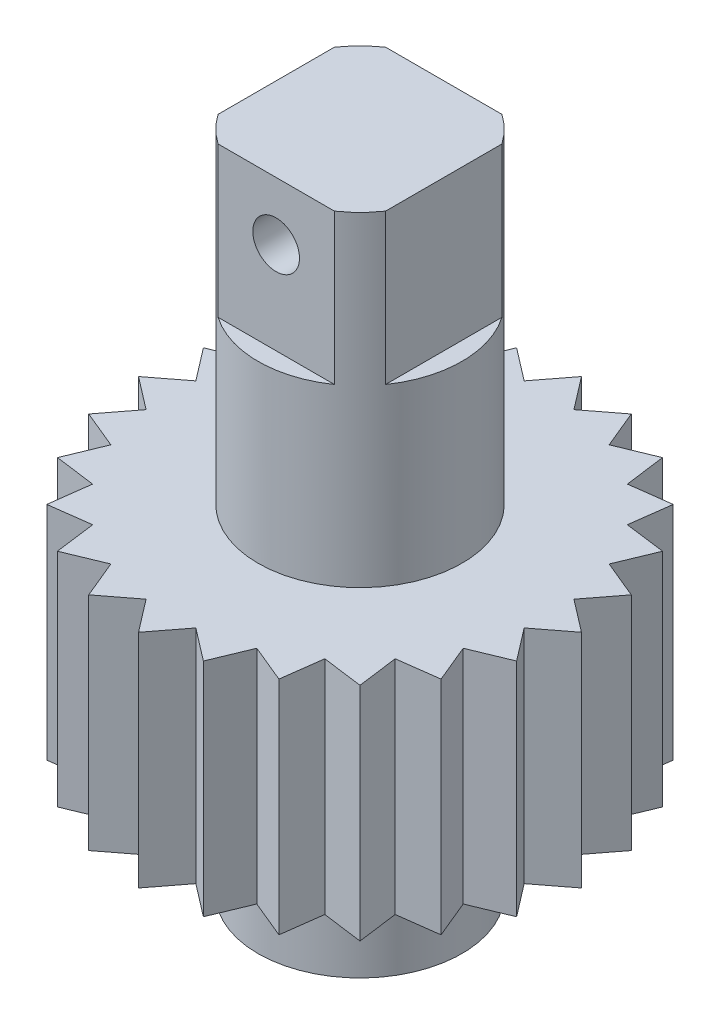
ISO-10303-21;
HEADER;
FILE_DESCRIPTION(('STEP AP214'),'2;1');
FILE_NAME('part.step','',(''),(''),'','','');
FILE_SCHEMA(('AUTOMOTIVE_DESIGN { 1 0 10303 214 1 1 1 1 }'));
ENDSEC;
DATA;
#1=APPLICATION_CONTEXT('core data for automotive mechanical design processes');
#2=APPLICATION_PROTOCOL_DEFINITION('international standard','automotive_design',2000,#1);
#3=PRODUCT_CONTEXT('',#1,'mechanical');
#4=PRODUCT('Part','Part','',(#3));
#5=PRODUCT_RELATED_PRODUCT_CATEGORY('part','',(#4));
#6=PRODUCT_DEFINITION_FORMATION('','',#4);
#7=PRODUCT_DEFINITION_CONTEXT('part definition',#1,'design');
#8=PRODUCT_DEFINITION('design','',#6,#7);
#9=PRODUCT_DEFINITION_SHAPE('','',#8);
#10=(LENGTH_UNIT() NAMED_UNIT(*) SI_UNIT(.MILLI.,.METRE.));
#11=(NAMED_UNIT(*) PLANE_ANGLE_UNIT() SI_UNIT($,.RADIAN.));
#12=(NAMED_UNIT(*) SI_UNIT($,.STERADIAN.) SOLID_ANGLE_UNIT());
#13=UNCERTAINTY_MEASURE_WITH_UNIT(LENGTH_MEASURE(1.E-05),#10,'distance_accuracy_value','');
#14=(GEOMETRIC_REPRESENTATION_CONTEXT(3) GLOBAL_UNCERTAINTY_ASSIGNED_CONTEXT((#13)) GLOBAL_UNIT_ASSIGNED_CONTEXT((#10,
#11,#12)) REPRESENTATION_CONTEXT('',''));
#15=CARTESIAN_POINT('',(0.,0.,0.));
#16=DIRECTION('',(0.,0.,1.));
#17=DIRECTION('',(1.,0.,0.));
#18=AXIS2_PLACEMENT_3D('',#15,#16,#17);
#19=CARTESIAN_POINT('',(0.,0.,0.));
#20=DIRECTION('',(0.,1.,0.));
#21=DIRECTION('',(0.,0.,1.));
#22=AXIS2_PLACEMENT_3D('',#19,#20,#21);
#23=PLANE('',#22);
#24=DIRECTION('',(-0.382683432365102,0.,0.923879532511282));
#25=VECTOR('',#24,1.);
#26=CARTESIAN_POINT('',(10.4485964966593,0.,-6.03249999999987));
#27=LINE('',#26,#25);
#28=CARTESIAN_POINT('',(10.4485964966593,0.,-6.03249999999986));
#29=VERTEX_POINT('',#28);
#30=CARTESIAN_POINT('',(9.59632168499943,0.,-3.97492659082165));
#31=VERTEX_POINT('',#30);
#32=EDGE_CURVE('E448',#29,#31,#27,.T.);
#33=ORIENTED_EDGE('',*,*,#32,.T.);
#34=DIRECTION('',(0.923879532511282,0.,0.382683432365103));
#35=VECTOR('',#34,1.);
#36=CARTESIAN_POINT('',(9.59632168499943,0.,-3.97492659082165));
#37=LINE('',#36,#35);
#38=CARTESIAN_POINT('',(11.6538950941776,0.,-3.12265177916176));
#39=VERTEX_POINT('',#38);
#40=EDGE_CURVE('E451',#31,#39,#37,.T.);
#41=ORIENTED_EDGE('',*,*,#40,.T.);
#42=DIRECTION('',(-0.608761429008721,0.,0.793353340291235));
#43=VECTOR('',#42,1.);
#44=CARTESIAN_POINT('',(11.6538950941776,0.,-3.12265177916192));
#45=LINE('',#44,#43);
#46=CARTESIAN_POINT('',(10.2981216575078,0.,-1.35577343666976));
#47=VERTEX_POINT('',#46);
#48=EDGE_CURVE('E820',#39,#47,#45,.T.);
#49=ORIENTED_EDGE('',*,*,#48,.T.);
#50=DIRECTION('',(0.793353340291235,0.,0.608761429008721));
#51=VECTOR('',#50,1.);
#52=CARTESIAN_POINT('',(10.2981216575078,0.,-1.35577343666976));
#53=LINE('',#52,#51);
#54=CARTESIAN_POINT('',(12.065,0.,0.));
#55=VERTEX_POINT('',#54);
#56=EDGE_CURVE('E817',#47,#55,#53,.T.);
#57=ORIENTED_EDGE('',*,*,#56,.T.);
#58=DIRECTION('',(-0.793353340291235,0.,0.60876142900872));
#59=VECTOR('',#58,1.);
#60=CARTESIAN_POINT('',(12.065,0.,0.));
#61=LINE('',#60,#59);
#62=CARTESIAN_POINT('',(10.2981216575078,0.,1.35577343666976));
#63=VERTEX_POINT('',#62);
#64=EDGE_CURVE('E804',#55,#63,#61,.T.);
#65=ORIENTED_EDGE('',*,*,#64,.T.);
#66=DIRECTION('',(0.60876142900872,0.,0.793353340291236));
#67=VECTOR('',#66,1.);
#68=CARTESIAN_POINT('',(10.2981216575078,0.,1.35577343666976));
#69=LINE('',#68,#67);
#70=CARTESIAN_POINT('',(11.6538950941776,0.,3.12265177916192));
#71=VERTEX_POINT('',#70);
#72=EDGE_CURVE('E801',#63,#71,#69,.T.);
#73=ORIENTED_EDGE('',*,*,#72,.T.);
#74=DIRECTION('',(-0.923879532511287,0.,0.382683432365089));
#75=VECTOR('',#74,1.);
#76=CARTESIAN_POINT('',(11.6538950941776,0.,3.12265177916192));
#77=LINE('',#76,#75);
#78=CARTESIAN_POINT('',(9.59632168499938,0.,3.97492659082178));
#79=VERTEX_POINT('',#78);
#80=EDGE_CURVE('E782',#71,#79,#77,.T.);
#81=ORIENTED_EDGE('',*,*,#80,.T.);
#82=DIRECTION('',(0.382683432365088,0.,0.923879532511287));
#83=VECTOR('',#82,1.);
#84=CARTESIAN_POINT('',(9.59632168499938,0.,3.97492659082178));
#85=LINE('',#84,#83);
#86=CARTESIAN_POINT('',(10.4485964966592,0.,6.03250000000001));
#87=VERTEX_POINT('',#86);
#88=EDGE_CURVE('E777',#79,#87,#85,.T.);
#89=ORIENTED_EDGE('',*,*,#88,.T.);
#90=DIRECTION('',(-0.99144486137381,0.,0.13052619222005));
#91=VECTOR('',#90,1.);
#92=CARTESIAN_POINT('',(10.4485964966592,0.,6.03250000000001));
#93=LINE('',#92,#91);
#94=CARTESIAN_POINT('',(8.24054824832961,0.,6.32319506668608));
#95=VERTEX_POINT('',#94);
#96=EDGE_CURVE('E766',#87,#95,#93,.T.);
#97=ORIENTED_EDGE('',*,*,#96,.T.);
#98=DIRECTION('',(0.130526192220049,0.,0.991444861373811));
#99=VECTOR('',#98,1.);
#100=CARTESIAN_POINT('',(8.24054824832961,0.,6.32319506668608));
#101=LINE('',#100,#99);
#102=CARTESIAN_POINT('',(8.53124331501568,0.,8.53124331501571));
#103=VERTEX_POINT('',#102);
#104=EDGE_CURVE('E761',#95,#103,#101,.T.);
#105=ORIENTED_EDGE('',*,*,#104,.T.);
#106=DIRECTION('',(-0.99144486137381,0.,-0.130526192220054));
#107=VECTOR('',#106,1.);
#108=CARTESIAN_POINT('',(8.53124331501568,0.,8.53124331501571));
#109=LINE('',#108,#107);
#110=CARTESIAN_POINT('',(6.32319506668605,0.,8.24054824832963));
#111=VERTEX_POINT('',#110);
#112=EDGE_CURVE('E750',#103,#111,#109,.T.);
#113=ORIENTED_EDGE('',*,*,#112,.T.);
#114=DIRECTION('',(-0.130526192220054,0.,0.99144486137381));
#115=VECTOR('',#114,1.);
#116=CARTESIAN_POINT('',(6.32319506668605,0.,8.24054824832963));
#117=LINE('',#116,#115);
#118=CARTESIAN_POINT('',(6.03249999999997,0.,10.4485964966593));
#119=VERTEX_POINT('',#118);
#120=EDGE_CURVE('E745',#111,#119,#117,.T.);
#121=ORIENTED_EDGE('',*,*,#120,.T.);
#122=DIRECTION('',(-0.923879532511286,0.,-0.382683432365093));
#123=VECTOR('',#122,1.);
#124=CARTESIAN_POINT('',(6.03249999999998,0.,10.4485964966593));
#125=LINE('',#124,#123);
#126=CARTESIAN_POINT('',(3.97492659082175,0.,9.59632168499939));
#127=VERTEX_POINT('',#126);
#128=EDGE_CURVE('E734',#119,#127,#125,.T.);
#129=ORIENTED_EDGE('',*,*,#128,.T.);
#130=DIRECTION('',(-0.382683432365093,0.,0.923879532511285));
#131=VECTOR('',#130,1.);
#132=CARTESIAN_POINT('',(3.97492659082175,0.,9.59632168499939));
#133=LINE('',#132,#131);
#134=CARTESIAN_POINT('',(3.12265177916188,0.,11.6538950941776));
#135=VERTEX_POINT('',#134);
#136=EDGE_CURVE('E729',#127,#135,#133,.T.);
#137=ORIENTED_EDGE('',*,*,#136,.T.);
#138=DIRECTION('',(-0.793353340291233,0.,-0.608761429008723));
#139=VECTOR('',#138,1.);
#140=CARTESIAN_POINT('',(3.12265177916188,0.,11.6538950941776));
#141=LINE('',#140,#139);
#142=CARTESIAN_POINT('',(1.35577343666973,0.,10.2981216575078));
#143=VERTEX_POINT('',#142);
#144=EDGE_CURVE('E718',#135,#143,#141,.T.);
#145=ORIENTED_EDGE('',*,*,#144,.T.);
#146=DIRECTION('',(-0.608761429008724,0.,0.793353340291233));
#147=VECTOR('',#146,1.);
#148=CARTESIAN_POINT('',(1.35577343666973,0.,10.2981216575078));
#149=LINE('',#148,#147);
#150=CARTESIAN_POINT('',(0.,0.,12.065));
#151=VERTEX_POINT('',#150);
#152=EDGE_CURVE('E713',#143,#151,#149,.T.);
#153=ORIENTED_EDGE('',*,*,#152,.T.);
#154=DIRECTION('',(-0.608761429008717,0.,-0.793353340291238));
#155=VECTOR('',#154,1.);
#156=CARTESIAN_POINT('',(0.,0.,12.065));
#157=LINE('',#156,#155);
#158=CARTESIAN_POINT('',(-1.3557734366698,0.,10.2981216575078));
#159=VERTEX_POINT('',#158);
#160=EDGE_CURVE('E702',#151,#159,#157,.T.);
#161=ORIENTED_EDGE('',*,*,#160,.T.);
#162=DIRECTION('',(-0.793353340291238,0.,0.608761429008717));
#163=VECTOR('',#162,1.);
#164=CARTESIAN_POINT('',(-1.3557734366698,0.,10.2981216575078));
#165=LINE('',#164,#163);
#166=CARTESIAN_POINT('',(-3.12265177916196,0.,11.6538950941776));
#167=VERTEX_POINT('',#166);
#168=EDGE_CURVE('E697',#159,#167,#165,.T.);
#169=ORIENTED_EDGE('',*,*,#168,.T.);
#170=DIRECTION('',(-0.382683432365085,0.,-0.923879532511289));
#171=VECTOR('',#170,1.);
#172=CARTESIAN_POINT('',(-3.12265177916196,0.,11.6538950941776));
#173=LINE('',#172,#171);
#174=CARTESIAN_POINT('',(-3.97492659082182,0.,9.59632168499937));
#175=VERTEX_POINT('',#174);
#176=EDGE_CURVE('E686',#167,#175,#173,.T.);
#177=ORIENTED_EDGE('',*,*,#176,.T.);
#178=DIRECTION('',(-0.923879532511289,0.,0.382683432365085));
#179=VECTOR('',#178,1.);
#180=CARTESIAN_POINT('',(-3.97492659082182,0.,9.59632168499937));
#181=LINE('',#180,#179);
#182=CARTESIAN_POINT('',(-6.03250000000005,0.,10.4485964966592));
#183=VERTEX_POINT('',#182);
#184=EDGE_CURVE('E681',#175,#183,#181,.T.);
#185=ORIENTED_EDGE('',*,*,#184,.T.);
#186=DIRECTION('',(-0.130526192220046,0.,-0.991444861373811));
#187=VECTOR('',#186,1.);
#188=CARTESIAN_POINT('',(-6.03250000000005,0.,10.4485964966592));
#189=LINE('',#188,#187);
#190=CARTESIAN_POINT('',(-6.32319506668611,0.,8.24054824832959));
#191=VERTEX_POINT('',#190);
#192=EDGE_CURVE('E670',#183,#191,#189,.T.);
#193=ORIENTED_EDGE('',*,*,#192,.T.);
#194=DIRECTION('',(-0.991444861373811,0.,0.130526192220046));
#195=VECTOR('',#194,1.);
#196=CARTESIAN_POINT('',(-6.32319506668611,0.,8.24054824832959));
#197=LINE('',#196,#195);
#198=CARTESIAN_POINT('',(-8.53124331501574,0.,8.53124331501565));
#199=VERTEX_POINT('',#198);
#200=EDGE_CURVE('E665',#191,#199,#197,.T.);
#201=ORIENTED_EDGE('',*,*,#200,.T.);
#202=DIRECTION('',(0.130526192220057,0.,-0.99144486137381));
#203=VECTOR('',#202,1.);
#204=CARTESIAN_POINT('',(-8.53124331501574,0.,8.53124331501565));
#205=LINE('',#204,#203);
#206=CARTESIAN_POINT('',(-8.24054824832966,0.,6.32319506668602));
#207=VERTEX_POINT('',#206);
#208=EDGE_CURVE('E654',#199,#207,#205,.T.);
#209=ORIENTED_EDGE('',*,*,#208,.T.);
#210=DIRECTION('',(-0.99144486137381,0.,-0.130526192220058));
#211=VECTOR('',#210,1.);
#212=CARTESIAN_POINT('',(-8.24054824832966,0.,6.32319506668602));
#213=LINE('',#212,#211);
#214=CARTESIAN_POINT('',(-10.4485964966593,0.,6.03249999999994));
#215=VERTEX_POINT('',#214);
#216=EDGE_CURVE('E649',#207,#215,#213,.T.);
#217=ORIENTED_EDGE('',*,*,#216,.T.);
#218=DIRECTION('',(0.382683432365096,0.,-0.923879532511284));
#219=VECTOR('',#218,1.);
#220=CARTESIAN_POINT('',(-10.4485964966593,0.,6.03249999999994));
#221=LINE('',#220,#219);
#222=CARTESIAN_POINT('',(-9.59632168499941,0.,3.97492659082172));
#223=VERTEX_POINT('',#222);
#224=EDGE_CURVE('E638',#215,#223,#221,.T.);
#225=ORIENTED_EDGE('',*,*,#224,.T.);
#226=DIRECTION('',(-0.923879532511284,0.,-0.382683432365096));
#227=VECTOR('',#226,1.);
#228=CARTESIAN_POINT('',(-9.59632168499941,0.,3.97492659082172));
#229=LINE('',#228,#227);
#230=CARTESIAN_POINT('',(-11.6538950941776,0.,3.12265177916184));
#231=VERTEX_POINT('',#230);
#232=EDGE_CURVE('E633',#223,#231,#229,.T.);
#233=ORIENTED_EDGE('',*,*,#232,.T.);
#234=DIRECTION('',(0.608761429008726,0.,-0.793353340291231));
#235=VECTOR('',#234,1.);
#236=CARTESIAN_POINT('',(-11.6538950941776,0.,3.12265177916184));
#237=LINE('',#236,#235);
#238=CARTESIAN_POINT('',(-10.2981216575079,0.,1.35577343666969));
#239=VERTEX_POINT('',#238);
#240=EDGE_CURVE('E622',#231,#239,#237,.T.);
#241=ORIENTED_EDGE('',*,*,#240,.T.);
#242=DIRECTION('',(-0.793353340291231,0.,-0.608761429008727));
#243=VECTOR('',#242,1.);
#244=CARTESIAN_POINT('',(-10.2981216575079,0.,1.35577343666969));
#245=LINE('',#244,#243);
#246=CARTESIAN_POINT('',(-12.065,0.,0.));
#247=VERTEX_POINT('',#246);
#248=EDGE_CURVE('E617',#239,#247,#245,.T.);
#249=ORIENTED_EDGE('',*,*,#248,.T.);
#250=DIRECTION('',(0.79335334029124,0.,-0.608761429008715));
#251=VECTOR('',#250,1.);
#252=CARTESIAN_POINT('',(-12.065,0.,0.));
#253=LINE('',#252,#251);
#254=CARTESIAN_POINT('',(-10.2981216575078,0.,-1.35577343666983));
#255=VERTEX_POINT('',#254);
#256=EDGE_CURVE('E606',#247,#255,#253,.T.);
#257=ORIENTED_EDGE('',*,*,#256,.T.);
#258=DIRECTION('',(-0.608761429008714,0.,-0.79335334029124));
#259=VECTOR('',#258,1.);
#260=CARTESIAN_POINT('',(-10.2981216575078,0.,-1.35577343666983));
#261=LINE('',#260,#259);
#262=CARTESIAN_POINT('',(-11.6538950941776,0.,-3.122651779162));
#263=VERTEX_POINT('',#262);
#264=EDGE_CURVE('E601',#255,#263,#261,.T.);
#265=ORIENTED_EDGE('',*,*,#264,.T.);
#266=DIRECTION('',(0.92387953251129,0.,-0.382683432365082));
#267=VECTOR('',#266,1.);
#268=CARTESIAN_POINT('',(-11.6538950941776,0.,-3.122651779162));
#269=LINE('',#268,#267);
#270=CARTESIAN_POINT('',(-9.59632168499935,0.,-3.97492659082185));
#271=VERTEX_POINT('',#270);
#272=EDGE_CURVE('E590',#263,#271,#269,.T.);
#273=ORIENTED_EDGE('',*,*,#272,.T.);
#274=DIRECTION('',(-0.382683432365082,0.,-0.92387953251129));
#275=VECTOR('',#274,1.);
#276=CARTESIAN_POINT('',(-9.59632168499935,0.,-3.97492659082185));
#277=LINE('',#276,#275);
#278=CARTESIAN_POINT('',(-10.4485964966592,0.,-6.03250000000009));
#279=VERTEX_POINT('',#278);
#280=EDGE_CURVE('E585',#271,#279,#277,.T.);
#281=ORIENTED_EDGE('',*,*,#280,.T.);
#282=DIRECTION('',(0.991444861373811,0.,-0.130526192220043));
#283=VECTOR('',#282,1.);
#284=CARTESIAN_POINT('',(-10.4485964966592,0.,-6.03250000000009));
#285=LINE('',#284,#283);
#286=CARTESIAN_POINT('',(-8.24054824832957,0.,-6.32319506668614));
#287=VERTEX_POINT('',#286);
#288=EDGE_CURVE('E574',#279,#287,#285,.T.);
#289=ORIENTED_EDGE('',*,*,#288,.T.);
#290=DIRECTION('',(-0.130526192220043,0.,-0.991444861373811));
#291=VECTOR('',#290,1.);
#292=CARTESIAN_POINT('',(-8.24054824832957,0.,-6.32319506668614));
#293=LINE('',#292,#291);
#294=CARTESIAN_POINT('',(-8.53124331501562,0.,-8.53124331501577));
#295=VERTEX_POINT('',#294);
#296=EDGE_CURVE('E569',#287,#295,#293,.T.);
#297=ORIENTED_EDGE('',*,*,#296,.T.);
#298=DIRECTION('',(0.991444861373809,0.,0.130526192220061));
#299=VECTOR('',#298,1.);
#300=CARTESIAN_POINT('',(-8.53124331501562,0.,-8.53124331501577));
#301=LINE('',#300,#299);
#302=CARTESIAN_POINT('',(-6.32319506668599,0.,-8.24054824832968));
#303=VERTEX_POINT('',#302);
#304=EDGE_CURVE('E558',#295,#303,#301,.T.);
#305=ORIENTED_EDGE('',*,*,#304,.T.);
#306=DIRECTION('',(0.130526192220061,0.,-0.991444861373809));
#307=VECTOR('',#306,1.);
#308=CARTESIAN_POINT('',(-6.32319506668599,0.,-8.24054824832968));
#309=LINE('',#308,#307);
#310=CARTESIAN_POINT('',(-6.0324999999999,0.,-10.4485964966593));
#311=VERTEX_POINT('',#310);
#312=EDGE_CURVE('E553',#303,#311,#309,.T.);
#313=ORIENTED_EDGE('',*,*,#312,.T.);
#314=DIRECTION('',(0.923879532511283,0.,0.382683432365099));
#315=VECTOR('',#314,1.);
#316=CARTESIAN_POINT('',(-6.0324999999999,0.,-10.4485964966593));
#317=LINE('',#316,#315);
#318=CARTESIAN_POINT('',(-3.97492659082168,0.,-9.59632168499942));
#319=VERTEX_POINT('',#318);
#320=EDGE_CURVE('E542',#311,#319,#317,.T.);
#321=ORIENTED_EDGE('',*,*,#320,.T.);
#322=DIRECTION('',(0.382683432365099,0.,-0.923879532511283));
#323=VECTOR('',#322,1.);
#324=CARTESIAN_POINT('',(-3.97492659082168,0.,-9.59632168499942));
#325=LINE('',#324,#323);
#326=CARTESIAN_POINT('',(-3.1226517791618,0.,-11.6538950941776));
#327=VERTEX_POINT('',#326);
#328=EDGE_CURVE('E537',#319,#327,#325,.T.);
#329=ORIENTED_EDGE('',*,*,#328,.T.);
#330=DIRECTION('',(0.793353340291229,0.,0.608761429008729));
#331=VECTOR('',#330,1.);
#332=CARTESIAN_POINT('',(-3.1226517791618,0.,-11.6538950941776));
#333=LINE('',#332,#331);
#334=CARTESIAN_POINT('',(-1.35577343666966,0.,-10.2981216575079));
#335=VERTEX_POINT('',#334);
#336=EDGE_CURVE('E526',#327,#335,#333,.T.);
#337=ORIENTED_EDGE('',*,*,#336,.T.);
#338=DIRECTION('',(0.608761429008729,0.,-0.793353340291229));
#339=VECTOR('',#338,1.);
#340=CARTESIAN_POINT('',(-1.35577343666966,0.,-10.2981216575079));
#341=LINE('',#340,#339);
#342=CARTESIAN_POINT('',(1.2711300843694E-13,0.,-12.065));
#343=VERTEX_POINT('',#342);
#344=EDGE_CURVE('E521',#335,#343,#341,.T.);
#345=ORIENTED_EDGE('',*,*,#344,.T.);
#346=DIRECTION('',(0.608761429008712,0.,0.793353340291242));
#347=VECTOR('',#346,1.);
#348=CARTESIAN_POINT('',(1.27502175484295E-13,0.,-12.065));
#349=LINE('',#348,#347);
#350=CARTESIAN_POINT('',(1.35577343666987,0.,-10.2981216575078));
#351=VERTEX_POINT('',#350);
#352=EDGE_CURVE('E510',#343,#351,#349,.T.);
#353=ORIENTED_EDGE('',*,*,#352,.T.);
#354=DIRECTION('',(0.793353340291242,0.,-0.608761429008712));
#355=VECTOR('',#354,1.);
#356=CARTESIAN_POINT('',(1.35577343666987,0.,-10.2981216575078));
#357=LINE('',#356,#355);
#358=CARTESIAN_POINT('',(3.12265177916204,0.,-11.6538950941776));
#359=VERTEX_POINT('',#358);
#360=EDGE_CURVE('E505',#351,#359,#357,.T.);
#361=ORIENTED_EDGE('',*,*,#360,.T.);
#362=DIRECTION('',(0.382683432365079,0.,0.923879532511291));
#363=VECTOR('',#362,1.);
#364=CARTESIAN_POINT('',(3.12265177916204,0.,-11.6538950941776));
#365=LINE('',#364,#363);
#366=CARTESIAN_POINT('',(3.97492659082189,0.,-9.59632168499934));
#367=VERTEX_POINT('',#366);
#368=EDGE_CURVE('E494',#359,#367,#365,.T.);
#369=ORIENTED_EDGE('',*,*,#368,.T.);
#370=DIRECTION('',(0.923879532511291,0.,-0.382683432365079));
#371=VECTOR('',#370,1.);
#372=CARTESIAN_POINT('',(3.97492659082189,0.,-9.59632168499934));
#373=LINE('',#372,#371);
#374=CARTESIAN_POINT('',(6.03250000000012,0.,-10.4485964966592));
#375=VERTEX_POINT('',#374);
#376=EDGE_CURVE('E489',#367,#375,#373,.T.);
#377=ORIENTED_EDGE('',*,*,#376,.T.);
#378=DIRECTION('',(0.130526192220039,0.,0.991444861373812));
#379=VECTOR('',#378,1.);
#380=CARTESIAN_POINT('',(6.03250000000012,0.,-10.4485964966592));
#381=LINE('',#380,#379);
#382=CARTESIAN_POINT('',(6.32319506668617,0.,-8.24054824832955));
#383=VERTEX_POINT('',#382);
#384=EDGE_CURVE('E478',#375,#383,#381,.T.);
#385=ORIENTED_EDGE('',*,*,#384,.T.);
#386=DIRECTION('',(0.991444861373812,0.,-0.130526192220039));
#387=VECTOR('',#386,1.);
#388=CARTESIAN_POINT('',(6.32319506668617,0.,-8.24054824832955));
#389=LINE('',#388,#387);
#390=CARTESIAN_POINT('',(8.5312433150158,0.,-8.53124331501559));
#391=VERTEX_POINT('',#390);
#392=EDGE_CURVE('E473',#383,#391,#389,.T.);
#393=ORIENTED_EDGE('',*,*,#392,.T.);
#394=DIRECTION('',(-0.130526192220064,0.,0.991444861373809));
#395=VECTOR('',#394,1.);
#396=CARTESIAN_POINT('',(8.5312433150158,0.,-8.53124331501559));
#397=LINE('',#396,#395);
#398=CARTESIAN_POINT('',(8.2405482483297,0.,-6.32319506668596));
#399=VERTEX_POINT('',#398);
#400=EDGE_CURVE('E462',#391,#399,#397,.T.);
#401=ORIENTED_EDGE('',*,*,#400,.T.);
#402=DIRECTION('',(0.991444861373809,0.,0.130526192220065));
#403=VECTOR('',#402,1.);
#404=CARTESIAN_POINT('',(8.2405482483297,0.,-6.32319506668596));
#405=LINE('',#404,#403);
#406=EDGE_CURVE('E458',#399,#29,#405,.T.);
#407=ORIENTED_EDGE('',*,*,#406,.T.);
#408=EDGE_LOOP('',(#33,#41,#49,#57,#65,#73,#81,#89,#97,#105,#113,#121,#129,#137,#145,#153,#161,
#169,#177,#185,#193,#201,#209,#217,#225,#233,#241,#249,#257,#265,#273,#281,#289,#297,#305,#313,
#321,#329,#337,#345,#353,#361,#369,#377,#385,#393,#401,#407));
#409=FACE_BOUND('',#408,.T.);
#410=CARTESIAN_POINT('',(0.,0.,0.));
#411=DIRECTION('',(0.,1.,0.));
#412=DIRECTION('',(0.,0.,1.));
#413=AXIS2_PLACEMENT_3D('',#410,#411,#412);
#414=CIRCLE('',#413,5.55625);
#415=CARTESIAN_POINT('',(0.,0.,5.55625));
#416=VERTEX_POINT('',#415);
#417=EDGE_CURVE('E11',#416,#416,#414,.F.);
#418=ORIENTED_EDGE('',*,*,#417,.F.);
#419=EDGE_LOOP('',(#418));
#420=FACE_BOUND('',#419,.T.);
#421=ADVANCED_FACE('F26',(#409,#420),#23,.F.);
#422=CARTESIAN_POINT('',(0.,21.59,0.));
#423=DIRECTION('',(0.,1.,0.));
#424=DIRECTION('',(0.,0.,1.));
#425=AXIS2_PLACEMENT_3D('',#422,#423,#424);
#426=PLANE('',#425);
#427=CARTESIAN_POINT('',(0.,21.59,0.));
#428=DIRECTION('',(0.,1.,0.));
#429=DIRECTION('',(0.,0.,1.));
#430=AXIS2_PLACEMENT_3D('',#427,#428,#429);
#431=CIRCLE('',#430,5.55625);
#432=CARTESIAN_POINT('',(-4.5640625,21.59,-3.16879276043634));
#433=VERTEX_POINT('',#432);
#434=CARTESIAN_POINT('',(-4.5640625,21.59,3.16879276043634));
#435=VERTEX_POINT('',#434);
#436=EDGE_CURVE('E47',#433,#435,#431,.T.);
#437=ORIENTED_EDGE('',*,*,#436,.T.);
#438=DIRECTION('',(0.,0.,-1.));
#439=VECTOR('',#438,1.);
#440=CARTESIAN_POINT('',(-4.5640625,21.59,3.16879276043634));
#441=LINE('',#440,#439);
#442=EDGE_CURVE('E416',#435,#433,#441,.T.);
#443=ORIENTED_EDGE('',*,*,#442,.T.);
#444=EDGE_LOOP('',(#437,#443));
#445=FACE_BOUND('',#444,.T.);
#446=ADVANCED_FACE('F880',(#445),#426,.T.);
#447=CARTESIAN_POINT('',(4.5640625,21.59,3.16879276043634));
#448=VERTEX_POINT('',#447);
#449=CARTESIAN_POINT('',(4.5640625,21.59,-3.16879276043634));
#450=VERTEX_POINT('',#449);
#451=EDGE_CURVE('E454',#448,#450,#431,.T.);
#452=ORIENTED_EDGE('',*,*,#451,.T.);
#453=DIRECTION('',(0.,0.,1.));
#454=VECTOR('',#453,1.);
#455=CARTESIAN_POINT('',(4.5640625,21.59,-3.16879276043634));
#456=LINE('',#455,#454);
#457=EDGE_CURVE('E390',#450,#448,#456,.T.);
#458=ORIENTED_EDGE('',*,*,#457,.T.);
#459=EDGE_LOOP('',(#452,#458));
#460=FACE_BOUND('',#459,.T.);
#461=ADVANCED_FACE('F842',(#460),#426,.T.);
#462=DIRECTION('',(-1.,0.,0.));
#463=VECTOR('',#462,1.);
#464=CARTESIAN_POINT('',(3.16879276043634,21.59,-4.5640625));
#465=LINE('',#464,#463);
#466=CARTESIAN_POINT('',(3.16879276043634,21.59,-4.5640625));
#467=VERTEX_POINT('',#466);
#468=CARTESIAN_POINT('',(-3.16879276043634,21.59,-4.5640625));
#469=VERTEX_POINT('',#468);
#470=EDGE_CURVE('E420',#467,#469,#465,.T.);
#471=ORIENTED_EDGE('',*,*,#470,.F.);
#472=EDGE_CURVE('E836',#467,#469,#431,.T.);
#473=ORIENTED_EDGE('',*,*,#472,.T.);
#474=EDGE_LOOP('',(#471,#473));
#475=FACE_BOUND('',#474,.T.);
#476=ADVANCED_FACE('F881',(#475),#426,.T.);
#477=CARTESIAN_POINT('',(0.,12.065,0.));
#478=DIRECTION('',(0.,1.,0.));
#479=DIRECTION('',(0.,0.,1.));
#480=AXIS2_PLACEMENT_3D('',#477,#478,#479);
#481=PLANE('',#480);
#482=DIRECTION('',(0.923879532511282,0.,0.382683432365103));
#483=VECTOR('',#482,1.);
#484=CARTESIAN_POINT('',(9.59632168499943,12.065,-3.97492659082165));
#485=LINE('',#484,#483);
#486=CARTESIAN_POINT('',(9.59632168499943,12.065,-3.97492659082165));
#487=VERTEX_POINT('',#486);
#488=CARTESIAN_POINT('',(11.6538950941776,12.065,-3.12265177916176));
#489=VERTEX_POINT('',#488);
#490=EDGE_CURVE('E447',#487,#489,#485,.T.);
#491=ORIENTED_EDGE('',*,*,#490,.F.);
#492=DIRECTION('',(-0.382683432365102,0.,0.923879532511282));
#493=VECTOR('',#492,1.);
#494=CARTESIAN_POINT('',(10.4485964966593,12.065,-6.03249999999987));
#495=LINE('',#494,#493);
#496=CARTESIAN_POINT('',(10.4485964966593,12.065,-6.03249999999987));
#497=VERTEX_POINT('',#496);
#498=EDGE_CURVE('E455',#497,#487,#495,.T.);
#499=ORIENTED_EDGE('',*,*,#498,.F.);
#500=DIRECTION('',(0.991444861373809,0.,0.130526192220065));
#501=VECTOR('',#500,1.);
#502=CARTESIAN_POINT('',(8.2405482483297,12.065,-6.32319506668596));
#503=LINE('',#502,#501);
#504=CARTESIAN_POINT('',(8.2405482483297,12.065,-6.32319506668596));
#505=VERTEX_POINT('',#504);
#506=EDGE_CURVE('E465',#505,#497,#503,.T.);
#507=ORIENTED_EDGE('',*,*,#506,.F.);
#508=DIRECTION('',(-0.130526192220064,0.,0.991444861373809));
#509=VECTOR('',#508,1.);
#510=CARTESIAN_POINT('',(8.5312433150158,12.065,-8.53124331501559));
#511=LINE('',#510,#509);
#512=CARTESIAN_POINT('',(8.5312433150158,12.065,-8.53124331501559));
#513=VERTEX_POINT('',#512);
#514=EDGE_CURVE('E470',#513,#505,#511,.T.);
#515=ORIENTED_EDGE('',*,*,#514,.F.);
#516=DIRECTION('',(0.991444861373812,0.,-0.130526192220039));
#517=VECTOR('',#516,1.);
#518=CARTESIAN_POINT('',(6.32319506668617,12.065,-8.24054824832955));
#519=LINE('',#518,#517);
#520=CARTESIAN_POINT('',(6.32319506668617,12.065,-8.24054824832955));
#521=VERTEX_POINT('',#520);
#522=EDGE_CURVE('E481',#521,#513,#519,.T.);
#523=ORIENTED_EDGE('',*,*,#522,.F.);
#524=DIRECTION('',(0.130526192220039,0.,0.991444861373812));
#525=VECTOR('',#524,1.);
#526=CARTESIAN_POINT('',(6.03250000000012,12.065,-10.4485964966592));
#527=LINE('',#526,#525);
#528=CARTESIAN_POINT('',(6.03250000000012,12.065,-10.4485964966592));
#529=VERTEX_POINT('',#528);
#530=EDGE_CURVE('E486',#529,#521,#527,.T.);
#531=ORIENTED_EDGE('',*,*,#530,.F.);
#532=DIRECTION('',(0.923879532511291,0.,-0.382683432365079));
#533=VECTOR('',#532,1.);
#534=CARTESIAN_POINT('',(3.97492659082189,12.065,-9.59632168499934));
#535=LINE('',#534,#533);
#536=CARTESIAN_POINT('',(3.97492659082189,12.065,-9.59632168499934));
#537=VERTEX_POINT('',#536);
#538=EDGE_CURVE('E497',#537,#529,#535,.T.);
#539=ORIENTED_EDGE('',*,*,#538,.F.);
#540=DIRECTION('',(0.382683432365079,0.,0.923879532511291));
#541=VECTOR('',#540,1.);
#542=CARTESIAN_POINT('',(3.12265177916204,12.065,-11.6538950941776));
#543=LINE('',#542,#541);
#544=CARTESIAN_POINT('',(3.12265177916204,12.065,-11.6538950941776));
#545=VERTEX_POINT('',#544);
#546=EDGE_CURVE('E502',#545,#537,#543,.T.);
#547=ORIENTED_EDGE('',*,*,#546,.F.);
#548=DIRECTION('',(0.793353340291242,0.,-0.608761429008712));
#549=VECTOR('',#548,1.);
#550=CARTESIAN_POINT('',(1.35577343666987,12.065,-10.2981216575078));
#551=LINE('',#550,#549);
#552=CARTESIAN_POINT('',(1.35577343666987,12.065,-10.2981216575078));
#553=VERTEX_POINT('',#552);
#554=EDGE_CURVE('E513',#553,#545,#551,.T.);
#555=ORIENTED_EDGE('',*,*,#554,.F.);
#556=DIRECTION('',(0.608761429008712,0.,0.793353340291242));
#557=VECTOR('',#556,1.);
#558=CARTESIAN_POINT('',(1.27502175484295E-13,12.065,-12.065));
#559=LINE('',#558,#557);
#560=CARTESIAN_POINT('',(1.27502175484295E-13,12.065,-12.065));
#561=VERTEX_POINT('',#560);
#562=EDGE_CURVE('E518',#561,#553,#559,.T.);
#563=ORIENTED_EDGE('',*,*,#562,.F.);
#564=DIRECTION('',(0.608761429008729,0.,-0.793353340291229));
#565=VECTOR('',#564,1.);
#566=CARTESIAN_POINT('',(-1.35577343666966,12.065,-10.2981216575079));
#567=LINE('',#566,#565);
#568=CARTESIAN_POINT('',(-1.35577343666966,12.065,-10.2981216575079));
#569=VERTEX_POINT('',#568);
#570=EDGE_CURVE('E529',#569,#561,#567,.T.);
#571=ORIENTED_EDGE('',*,*,#570,.F.);
#572=DIRECTION('',(0.793353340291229,0.,0.608761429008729));
#573=VECTOR('',#572,1.);
#574=CARTESIAN_POINT('',(-3.1226517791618,12.065,-11.6538950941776));
#575=LINE('',#574,#573);
#576=CARTESIAN_POINT('',(-3.1226517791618,12.065,-11.6538950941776));
#577=VERTEX_POINT('',#576);
#578=EDGE_CURVE('E534',#577,#569,#575,.T.);
#579=ORIENTED_EDGE('',*,*,#578,.F.);
#580=DIRECTION('',(0.382683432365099,0.,-0.923879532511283));
#581=VECTOR('',#580,1.);
#582=CARTESIAN_POINT('',(-3.97492659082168,12.065,-9.59632168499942));
#583=LINE('',#582,#581);
#584=CARTESIAN_POINT('',(-3.97492659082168,12.065,-9.59632168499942));
#585=VERTEX_POINT('',#584);
#586=EDGE_CURVE('E545',#585,#577,#583,.T.);
#587=ORIENTED_EDGE('',*,*,#586,.F.);
#588=DIRECTION('',(0.923879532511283,0.,0.382683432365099));
#589=VECTOR('',#588,1.);
#590=CARTESIAN_POINT('',(-6.0324999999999,12.065,-10.4485964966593));
#591=LINE('',#590,#589);
#592=CARTESIAN_POINT('',(-6.0324999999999,12.065,-10.4485964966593));
#593=VERTEX_POINT('',#592);
#594=EDGE_CURVE('E550',#593,#585,#591,.T.);
#595=ORIENTED_EDGE('',*,*,#594,.F.);
#596=DIRECTION('',(0.130526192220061,0.,-0.991444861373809));
#597=VECTOR('',#596,1.);
#598=CARTESIAN_POINT('',(-6.32319506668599,12.065,-8.24054824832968));
#599=LINE('',#598,#597);
#600=CARTESIAN_POINT('',(-6.32319506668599,12.065,-8.24054824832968));
#601=VERTEX_POINT('',#600);
#602=EDGE_CURVE('E561',#601,#593,#599,.T.);
#603=ORIENTED_EDGE('',*,*,#602,.F.);
#604=DIRECTION('',(0.991444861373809,0.,0.130526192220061));
#605=VECTOR('',#604,1.);
#606=CARTESIAN_POINT('',(-8.53124331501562,12.065,-8.53124331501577));
#607=LINE('',#606,#605);
#608=CARTESIAN_POINT('',(-8.53124331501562,12.065,-8.53124331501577));
#609=VERTEX_POINT('',#608);
#610=EDGE_CURVE('E566',#609,#601,#607,.T.);
#611=ORIENTED_EDGE('',*,*,#610,.F.);
#612=DIRECTION('',(-0.130526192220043,0.,-0.991444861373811));
#613=VECTOR('',#612,1.);
#614=CARTESIAN_POINT('',(-8.24054824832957,12.065,-6.32319506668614));
#615=LINE('',#614,#613);
#616=CARTESIAN_POINT('',(-8.24054824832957,12.065,-6.32319506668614));
#617=VERTEX_POINT('',#616);
#618=EDGE_CURVE('E577',#617,#609,#615,.T.);
#619=ORIENTED_EDGE('',*,*,#618,.F.);
#620=DIRECTION('',(0.991444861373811,0.,-0.130526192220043));
#621=VECTOR('',#620,1.);
#622=CARTESIAN_POINT('',(-10.4485964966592,12.065,-6.03250000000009));
#623=LINE('',#622,#621);
#624=CARTESIAN_POINT('',(-10.4485964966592,12.065,-6.03250000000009));
#625=VERTEX_POINT('',#624);
#626=EDGE_CURVE('E582',#625,#617,#623,.T.);
#627=ORIENTED_EDGE('',*,*,#626,.F.);
#628=DIRECTION('',(-0.382683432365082,0.,-0.92387953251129));
#629=VECTOR('',#628,1.);
#630=CARTESIAN_POINT('',(-9.59632168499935,12.065,-3.97492659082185));
#631=LINE('',#630,#629);
#632=CARTESIAN_POINT('',(-9.59632168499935,12.065,-3.97492659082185));
#633=VERTEX_POINT('',#632);
#634=EDGE_CURVE('E593',#633,#625,#631,.T.);
#635=ORIENTED_EDGE('',*,*,#634,.F.);
#636=DIRECTION('',(0.92387953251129,0.,-0.382683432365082));
#637=VECTOR('',#636,1.);
#638=CARTESIAN_POINT('',(-11.6538950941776,12.065,-3.122651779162));
#639=LINE('',#638,#637);
#640=CARTESIAN_POINT('',(-11.6538950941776,12.065,-3.122651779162));
#641=VERTEX_POINT('',#640);
#642=EDGE_CURVE('E598',#641,#633,#639,.T.);
#643=ORIENTED_EDGE('',*,*,#642,.F.);
#644=DIRECTION('',(-0.608761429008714,0.,-0.79335334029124));
#645=VECTOR('',#644,1.);
#646=CARTESIAN_POINT('',(-10.2981216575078,12.065,-1.35577343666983));
#647=LINE('',#646,#645);
#648=CARTESIAN_POINT('',(-10.2981216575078,12.065,-1.35577343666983));
#649=VERTEX_POINT('',#648);
#650=EDGE_CURVE('E609',#649,#641,#647,.T.);
#651=ORIENTED_EDGE('',*,*,#650,.F.);
#652=DIRECTION('',(0.79335334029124,0.,-0.608761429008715));
#653=VECTOR('',#652,1.);
#654=CARTESIAN_POINT('',(-12.065,12.065,0.));
#655=LINE('',#654,#653);
#656=CARTESIAN_POINT('',(-12.065,12.065,0.));
#657=VERTEX_POINT('',#656);
#658=EDGE_CURVE('E614',#657,#649,#655,.T.);
#659=ORIENTED_EDGE('',*,*,#658,.F.);
#660=DIRECTION('',(-0.793353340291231,0.,-0.608761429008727));
#661=VECTOR('',#660,1.);
#662=CARTESIAN_POINT('',(-10.2981216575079,12.065,1.35577343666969));
#663=LINE('',#662,#661);
#664=CARTESIAN_POINT('',(-10.2981216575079,12.065,1.35577343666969));
#665=VERTEX_POINT('',#664);
#666=EDGE_CURVE('E625',#665,#657,#663,.T.);
#667=ORIENTED_EDGE('',*,*,#666,.F.);
#668=DIRECTION('',(0.608761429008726,0.,-0.793353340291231));
#669=VECTOR('',#668,1.);
#670=CARTESIAN_POINT('',(-11.6538950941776,12.065,3.12265177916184));
#671=LINE('',#670,#669);
#672=CARTESIAN_POINT('',(-11.6538950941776,12.065,3.12265177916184));
#673=VERTEX_POINT('',#672);
#674=EDGE_CURVE('E630',#673,#665,#671,.T.);
#675=ORIENTED_EDGE('',*,*,#674,.F.);
#676=DIRECTION('',(-0.923879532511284,0.,-0.382683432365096));
#677=VECTOR('',#676,1.);
#678=CARTESIAN_POINT('',(-9.59632168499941,12.065,3.97492659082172));
#679=LINE('',#678,#677);
#680=CARTESIAN_POINT('',(-9.59632168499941,12.065,3.97492659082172));
#681=VERTEX_POINT('',#680);
#682=EDGE_CURVE('E641',#681,#673,#679,.T.);
#683=ORIENTED_EDGE('',*,*,#682,.F.);
#684=DIRECTION('',(0.382683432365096,0.,-0.923879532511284));
#685=VECTOR('',#684,1.);
#686=CARTESIAN_POINT('',(-10.4485964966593,12.065,6.03249999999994));
#687=LINE('',#686,#685);
#688=CARTESIAN_POINT('',(-10.4485964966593,12.065,6.03249999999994));
#689=VERTEX_POINT('',#688);
#690=EDGE_CURVE('E646',#689,#681,#687,.T.);
#691=ORIENTED_EDGE('',*,*,#690,.F.);
#692=DIRECTION('',(-0.99144486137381,0.,-0.130526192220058));
#693=VECTOR('',#692,1.);
#694=CARTESIAN_POINT('',(-8.24054824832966,12.065,6.32319506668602));
#695=LINE('',#694,#693);
#696=CARTESIAN_POINT('',(-8.24054824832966,12.065,6.32319506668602));
#697=VERTEX_POINT('',#696);
#698=EDGE_CURVE('E657',#697,#689,#695,.T.);
#699=ORIENTED_EDGE('',*,*,#698,.F.);
#700=DIRECTION('',(0.130526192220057,0.,-0.99144486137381));
#701=VECTOR('',#700,1.);
#702=CARTESIAN_POINT('',(-8.53124331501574,12.065,8.53124331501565));
#703=LINE('',#702,#701);
#704=CARTESIAN_POINT('',(-8.53124331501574,12.065,8.53124331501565));
#705=VERTEX_POINT('',#704);
#706=EDGE_CURVE('E662',#705,#697,#703,.T.);
#707=ORIENTED_EDGE('',*,*,#706,.F.);
#708=DIRECTION('',(-0.991444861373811,0.,0.130526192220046));
#709=VECTOR('',#708,1.);
#710=CARTESIAN_POINT('',(-6.32319506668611,12.065,8.24054824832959));
#711=LINE('',#710,#709);
#712=CARTESIAN_POINT('',(-6.32319506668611,12.065,8.24054824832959));
#713=VERTEX_POINT('',#712);
#714=EDGE_CURVE('E673',#713,#705,#711,.T.);
#715=ORIENTED_EDGE('',*,*,#714,.F.);
#716=DIRECTION('',(-0.130526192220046,0.,-0.991444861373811));
#717=VECTOR('',#716,1.);
#718=CARTESIAN_POINT('',(-6.03250000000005,12.065,10.4485964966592));
#719=LINE('',#718,#717);
#720=CARTESIAN_POINT('',(-6.03250000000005,12.065,10.4485964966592));
#721=VERTEX_POINT('',#720);
#722=EDGE_CURVE('E678',#721,#713,#719,.T.);
#723=ORIENTED_EDGE('',*,*,#722,.F.);
#724=DIRECTION('',(-0.923879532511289,0.,0.382683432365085));
#725=VECTOR('',#724,1.);
#726=CARTESIAN_POINT('',(-3.97492659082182,12.065,9.59632168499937));
#727=LINE('',#726,#725);
#728=CARTESIAN_POINT('',(-3.97492659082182,12.065,9.59632168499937));
#729=VERTEX_POINT('',#728);
#730=EDGE_CURVE('E689',#729,#721,#727,.T.);
#731=ORIENTED_EDGE('',*,*,#730,.F.);
#732=DIRECTION('',(-0.382683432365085,0.,-0.923879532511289));
#733=VECTOR('',#732,1.);
#734=CARTESIAN_POINT('',(-3.12265177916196,12.065,11.6538950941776));
#735=LINE('',#734,#733);
#736=CARTESIAN_POINT('',(-3.12265177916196,12.065,11.6538950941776));
#737=VERTEX_POINT('',#736);
#738=EDGE_CURVE('E694',#737,#729,#735,.T.);
#739=ORIENTED_EDGE('',*,*,#738,.F.);
#740=DIRECTION('',(-0.793353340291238,0.,0.608761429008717));
#741=VECTOR('',#740,1.);
#742=CARTESIAN_POINT('',(-1.3557734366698,12.065,10.2981216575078));
#743=LINE('',#742,#741);
#744=CARTESIAN_POINT('',(-1.3557734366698,12.065,10.2981216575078));
#745=VERTEX_POINT('',#744);
#746=EDGE_CURVE('E705',#745,#737,#743,.T.);
#747=ORIENTED_EDGE('',*,*,#746,.F.);
#748=DIRECTION('',(-0.608761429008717,0.,-0.793353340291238));
#749=VECTOR('',#748,1.);
#750=CARTESIAN_POINT('',(0.,12.065,12.065));
#751=LINE('',#750,#749);
#752=CARTESIAN_POINT('',(0.,12.065,12.065));
#753=VERTEX_POINT('',#752);
#754=EDGE_CURVE('E710',#753,#745,#751,.T.);
#755=ORIENTED_EDGE('',*,*,#754,.F.);
#756=DIRECTION('',(-0.608761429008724,0.,0.793353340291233));
#757=VECTOR('',#756,1.);
#758=CARTESIAN_POINT('',(1.35577343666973,12.065,10.2981216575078));
#759=LINE('',#758,#757);
#760=CARTESIAN_POINT('',(1.35577343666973,12.065,10.2981216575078));
#761=VERTEX_POINT('',#760);
#762=EDGE_CURVE('E721',#761,#753,#759,.T.);
#763=ORIENTED_EDGE('',*,*,#762,.F.);
#764=DIRECTION('',(-0.793353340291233,0.,-0.608761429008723));
#765=VECTOR('',#764,1.);
#766=CARTESIAN_POINT('',(3.12265177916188,12.065,11.6538950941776));
#767=LINE('',#766,#765);
#768=CARTESIAN_POINT('',(3.12265177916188,12.065,11.6538950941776));
#769=VERTEX_POINT('',#768);
#770=EDGE_CURVE('E726',#769,#761,#767,.T.);
#771=ORIENTED_EDGE('',*,*,#770,.F.);
#772=DIRECTION('',(-0.382683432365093,0.,0.923879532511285));
#773=VECTOR('',#772,1.);
#774=CARTESIAN_POINT('',(3.97492659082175,12.065,9.59632168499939));
#775=LINE('',#774,#773);
#776=CARTESIAN_POINT('',(3.97492659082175,12.065,9.59632168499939));
#777=VERTEX_POINT('',#776);
#778=EDGE_CURVE('E737',#777,#769,#775,.T.);
#779=ORIENTED_EDGE('',*,*,#778,.F.);
#780=DIRECTION('',(-0.923879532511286,0.,-0.382683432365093));
#781=VECTOR('',#780,1.);
#782=CARTESIAN_POINT('',(6.03249999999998,12.065,10.4485964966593));
#783=LINE('',#782,#781);
#784=CARTESIAN_POINT('',(6.03249999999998,12.065,10.4485964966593));
#785=VERTEX_POINT('',#784);
#786=EDGE_CURVE('E742',#785,#777,#783,.T.);
#787=ORIENTED_EDGE('',*,*,#786,.F.);
#788=DIRECTION('',(-0.130526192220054,0.,0.99144486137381));
#789=VECTOR('',#788,1.);
#790=CARTESIAN_POINT('',(6.32319506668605,12.065,8.24054824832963));
#791=LINE('',#790,#789);
#792=CARTESIAN_POINT('',(6.32319506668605,12.065,8.24054824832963));
#793=VERTEX_POINT('',#792);
#794=EDGE_CURVE('E753',#793,#785,#791,.T.);
#795=ORIENTED_EDGE('',*,*,#794,.F.);
#796=DIRECTION('',(-0.99144486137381,0.,-0.130526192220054));
#797=VECTOR('',#796,1.);
#798=CARTESIAN_POINT('',(8.53124331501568,12.065,8.53124331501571));
#799=LINE('',#798,#797);
#800=CARTESIAN_POINT('',(8.53124331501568,12.065,8.53124331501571));
#801=VERTEX_POINT('',#800);
#802=EDGE_CURVE('E758',#801,#793,#799,.T.);
#803=ORIENTED_EDGE('',*,*,#802,.F.);
#804=DIRECTION('',(0.130526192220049,0.,0.991444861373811));
#805=VECTOR('',#804,1.);
#806=CARTESIAN_POINT('',(8.24054824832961,12.065,6.32319506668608));
#807=LINE('',#806,#805);
#808=CARTESIAN_POINT('',(8.24054824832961,12.065,6.32319506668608));
#809=VERTEX_POINT('',#808);
#810=EDGE_CURVE('E769',#809,#801,#807,.T.);
#811=ORIENTED_EDGE('',*,*,#810,.F.);
#812=DIRECTION('',(-0.99144486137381,0.,0.13052619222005));
#813=VECTOR('',#812,1.);
#814=CARTESIAN_POINT('',(10.4485964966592,12.065,6.03250000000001));
#815=LINE('',#814,#813);
#816=CARTESIAN_POINT('',(10.4485964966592,12.065,6.03250000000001));
#817=VERTEX_POINT('',#816);
#818=EDGE_CURVE('E774',#817,#809,#815,.T.);
#819=ORIENTED_EDGE('',*,*,#818,.F.);
#820=DIRECTION('',(0.382683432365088,0.,0.923879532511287));
#821=VECTOR('',#820,1.);
#822=CARTESIAN_POINT('',(9.59632168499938,12.065,3.97492659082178));
#823=LINE('',#822,#821);
#824=CARTESIAN_POINT('',(9.59632168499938,12.065,3.97492659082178));
#825=VERTEX_POINT('',#824);
#826=EDGE_CURVE('E785',#825,#817,#823,.T.);
#827=ORIENTED_EDGE('',*,*,#826,.F.);
#828=DIRECTION('',(-0.923879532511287,0.,0.382683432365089));
#829=VECTOR('',#828,1.);
#830=CARTESIAN_POINT('',(11.6538950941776,12.065,3.12265177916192));
#831=LINE('',#830,#829);
#832=CARTESIAN_POINT('',(11.6538950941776,12.065,3.12265177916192));
#833=VERTEX_POINT('',#832);
#834=EDGE_CURVE('E790',#833,#825,#831,.T.);
#835=ORIENTED_EDGE('',*,*,#834,.F.);
#836=DIRECTION('',(0.60876142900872,0.,0.793353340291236));
#837=VECTOR('',#836,1.);
#838=CARTESIAN_POINT('',(10.2981216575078,12.065,1.35577343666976));
#839=LINE('',#838,#837);
#840=CARTESIAN_POINT('',(10.2981216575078,12.065,1.35577343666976));
#841=VERTEX_POINT('',#840);
#842=EDGE_CURVE('E793',#841,#833,#839,.T.);
#843=ORIENTED_EDGE('',*,*,#842,.F.);
#844=DIRECTION('',(-0.793353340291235,0.,0.60876142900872));
#845=VECTOR('',#844,1.);
#846=CARTESIAN_POINT('',(12.065,12.065,0.));
#847=LINE('',#846,#845);
#848=CARTESIAN_POINT('',(12.065,12.065,0.));
#849=VERTEX_POINT('',#848);
#850=EDGE_CURVE('E798',#849,#841,#847,.T.);
#851=ORIENTED_EDGE('',*,*,#850,.F.);
#852=DIRECTION('',(0.793353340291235,0.,0.608761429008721));
#853=VECTOR('',#852,1.);
#854=CARTESIAN_POINT('',(10.2981216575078,12.065,-1.35577343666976));
#855=LINE('',#854,#853);
#856=CARTESIAN_POINT('',(10.2981216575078,12.065,-1.35577343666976));
#857=VERTEX_POINT('',#856);
#858=EDGE_CURVE('E810',#857,#849,#855,.T.);
#859=ORIENTED_EDGE('',*,*,#858,.F.);
#860=DIRECTION('',(-0.608761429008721,0.,0.793353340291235));
#861=VECTOR('',#860,1.);
#862=CARTESIAN_POINT('',(11.6538950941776,12.065,-3.12265177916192));
#863=LINE('',#862,#861);
#864=EDGE_CURVE('E814',#489,#857,#863,.T.);
#865=ORIENTED_EDGE('',*,*,#864,.F.);
#866=EDGE_LOOP('',(#491,#499,#507,#515,#523,#531,#539,#547,#555,#563,#571,#579,#587,#595,#603,
#611,#619,#627,#635,#643,#651,#659,#667,#675,#683,#691,#699,#707,#715,#723,#731,#739,#747,#755,
#763,#771,#779,#787,#795,#803,#811,#819,#827,#835,#843,#851,#859,#865));
#867=FACE_BOUND('',#866,.T.);
#868=CARTESIAN_POINT('',(0.,12.065,0.));
#869=DIRECTION('',(0.,1.,0.));
#870=DIRECTION('',(0.,0.,1.));
#871=AXIS2_PLACEMENT_3D('',#868,#869,#870);
#872=CIRCLE('',#871,5.55625);
#873=CARTESIAN_POINT('',(0.,12.065,5.55625));
#874=VERTEX_POINT('',#873);
#875=EDGE_CURVE('E382',#874,#874,#872,.T.);
#876=ORIENTED_EDGE('',*,*,#875,.F.);
#877=EDGE_LOOP('',(#876));
#878=FACE_BOUND('',#877,.T.);
#879=ADVANCED_FACE('F28',(#867,#878),#481,.T.);
#880=CARTESIAN_POINT('',(10.2981216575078,0.,-1.35577343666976));
#881=DIRECTION('',(-0.608761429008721,0.,0.793353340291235));
#882=DIRECTION('',(0.793353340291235,0.,0.608761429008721));
#883=AXIS2_PLACEMENT_3D('',#880,#881,#882);
#884=PLANE('',#883);
#885=ORIENTED_EDGE('',*,*,#858,.T.);
#886=DIRECTION('',(0.,1.,0.));
#887=VECTOR('',#886,1.);
#888=CARTESIAN_POINT('',(12.065,0.,0.));
#889=LINE('',#888,#887);
#890=EDGE_CURVE('E823',#55,#849,#889,.T.);
#891=ORIENTED_EDGE('',*,*,#890,.F.);
#892=ORIENTED_EDGE('',*,*,#56,.F.);
#893=DIRECTION('',(0.,1.,0.));
#894=VECTOR('',#893,1.);
#895=CARTESIAN_POINT('',(10.2981216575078,0.,-1.35577343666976));
#896=LINE('',#895,#894);
#897=EDGE_CURVE('E34',#47,#857,#896,.T.);
#898=ORIENTED_EDGE('',*,*,#897,.T.);
#899=EDGE_LOOP('',(#885,#891,#892,#898));
#900=FACE_BOUND('',#899,.T.);
#901=ADVANCED_FACE('F891',(#900),#884,.F.);
#902=CARTESIAN_POINT('',(11.6538950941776,0.,-3.12265177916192));
#903=DIRECTION('',(-0.793353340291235,0.,-0.608761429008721));
#904=DIRECTION('',(-0.608761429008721,0.,0.793353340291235));
#905=AXIS2_PLACEMENT_3D('',#902,#903,#904);
#906=PLANE('',#905);
#907=ORIENTED_EDGE('',*,*,#864,.T.);
#908=ORIENTED_EDGE('',*,*,#897,.F.);
#909=ORIENTED_EDGE('',*,*,#48,.F.);
#910=DIRECTION('',(0.,1.,0.));
#911=VECTOR('',#910,1.);
#912=CARTESIAN_POINT('',(11.6538950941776,0.,-3.12265177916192));
#913=LINE('',#912,#911);
#914=EDGE_CURVE('E825',#39,#489,#913,.T.);
#915=ORIENTED_EDGE('',*,*,#914,.T.);
#916=EDGE_LOOP('',(#907,#908,#909,#915));
#917=FACE_BOUND('',#916,.T.);
#918=ADVANCED_FACE('F894',(#917),#906,.F.);
#919=CARTESIAN_POINT('',(10.2981216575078,0.,1.35577343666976));
#920=DIRECTION('',(-0.793353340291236,0.,0.60876142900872));
#921=DIRECTION('',(0.60876142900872,0.,0.793353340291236));
#922=AXIS2_PLACEMENT_3D('',#919,#920,#921);
#923=PLANE('',#922);
#924=ORIENTED_EDGE('',*,*,#842,.T.);
#925=DIRECTION('',(0.,1.,0.));
#926=VECTOR('',#925,1.);
#927=CARTESIAN_POINT('',(11.6538950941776,0.,3.12265177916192));
#928=LINE('',#927,#926);
#929=EDGE_CURVE('E807',#71,#833,#928,.T.);
#930=ORIENTED_EDGE('',*,*,#929,.F.);
#931=ORIENTED_EDGE('',*,*,#72,.F.);
#932=DIRECTION('',(0.,1.,0.));
#933=VECTOR('',#932,1.);
#934=CARTESIAN_POINT('',(10.2981216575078,0.,1.35577343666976));
#935=LINE('',#934,#933);
#936=EDGE_CURVE('E808',#63,#841,#935,.T.);
#937=ORIENTED_EDGE('',*,*,#936,.T.);
#938=EDGE_LOOP('',(#924,#930,#931,#937));
#939=FACE_BOUND('',#938,.T.);
#940=ADVANCED_FACE('F898',(#939),#923,.F.);
#941=CARTESIAN_POINT('',(12.065,0.,0.));
#942=DIRECTION('',(-0.60876142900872,0.,-0.793353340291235));
#943=DIRECTION('',(-0.793353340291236,0.,0.60876142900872));
#944=AXIS2_PLACEMENT_3D('',#941,#942,#943);
#945=PLANE('',#944);
#946=ORIENTED_EDGE('',*,*,#850,.T.);
#947=ORIENTED_EDGE('',*,*,#936,.F.);
#948=ORIENTED_EDGE('',*,*,#64,.F.);
#949=ORIENTED_EDGE('',*,*,#890,.T.);
#950=EDGE_LOOP('',(#946,#947,#948,#949));
#951=FACE_BOUND('',#950,.T.);
#952=ADVANCED_FACE('F902',(#951),#945,.F.);
#953=CARTESIAN_POINT('',(9.59632168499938,0.,3.97492659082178));
#954=DIRECTION('',(-0.923879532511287,0.,0.382683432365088));
#955=DIRECTION('',(0.382683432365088,0.,0.923879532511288));
#956=AXIS2_PLACEMENT_3D('',#953,#954,#955);
#957=PLANE('',#956);
#958=ORIENTED_EDGE('',*,*,#826,.T.);
#959=DIRECTION('',(0.,1.,0.));
#960=VECTOR('',#959,1.);
#961=CARTESIAN_POINT('',(10.4485964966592,0.,6.03250000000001));
#962=LINE('',#961,#960);
#963=EDGE_CURVE('E780',#87,#817,#962,.T.);
#964=ORIENTED_EDGE('',*,*,#963,.F.);
#965=ORIENTED_EDGE('',*,*,#88,.F.);
#966=DIRECTION('',(0.,1.,0.));
#967=VECTOR('',#966,1.);
#968=CARTESIAN_POINT('',(9.59632168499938,0.,3.97492659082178));
#969=LINE('',#968,#967);
#970=EDGE_CURVE('E783',#79,#825,#969,.T.);
#971=ORIENTED_EDGE('',*,*,#970,.T.);
#972=EDGE_LOOP('',(#958,#964,#965,#971));
#973=FACE_BOUND('',#972,.T.);
#974=ADVANCED_FACE('F906',(#973),#957,.F.);
#975=CARTESIAN_POINT('',(11.6538950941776,0.,3.12265177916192));
#976=DIRECTION('',(-0.382683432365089,0.,-0.923879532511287));
#977=DIRECTION('',(-0.923879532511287,0.,0.382683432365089));
#978=AXIS2_PLACEMENT_3D('',#975,#976,#977);
#979=PLANE('',#978);
#980=ORIENTED_EDGE('',*,*,#834,.T.);
#981=ORIENTED_EDGE('',*,*,#970,.F.);
#982=ORIENTED_EDGE('',*,*,#80,.F.);
#983=ORIENTED_EDGE('',*,*,#929,.T.);
#984=EDGE_LOOP('',(#980,#981,#982,#983));
#985=FACE_BOUND('',#984,.T.);
#986=ADVANCED_FACE('F908',(#985),#979,.F.);
#987=CARTESIAN_POINT('',(8.24054824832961,0.,6.32319506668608));
#988=DIRECTION('',(-0.991444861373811,0.,0.130526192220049));
#989=DIRECTION('',(0.130526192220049,0.,0.991444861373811));
#990=AXIS2_PLACEMENT_3D('',#987,#988,#989);
#991=PLANE('',#990);
#992=ORIENTED_EDGE('',*,*,#810,.T.);
#993=DIRECTION('',(0.,1.,0.));
#994=VECTOR('',#993,1.);
#995=CARTESIAN_POINT('',(8.53124331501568,0.,8.53124331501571));
#996=LINE('',#995,#994);
#997=EDGE_CURVE('E764',#103,#801,#996,.T.);
#998=ORIENTED_EDGE('',*,*,#997,.F.);
#999=ORIENTED_EDGE('',*,*,#104,.F.);
#1000=DIRECTION('',(0.,1.,0.));
#1001=VECTOR('',#1000,1.);
#1002=CARTESIAN_POINT('',(8.24054824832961,0.,6.32319506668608));
#1003=LINE('',#1002,#1001);
#1004=EDGE_CURVE('E767',#95,#809,#1003,.T.);
#1005=ORIENTED_EDGE('',*,*,#1004,.T.);
#1006=EDGE_LOOP('',(#992,#998,#999,#1005));
#1007=FACE_BOUND('',#1006,.T.);
#1008=ADVANCED_FACE('F911',(#1007),#991,.F.);
#1009=CARTESIAN_POINT('',(10.4485964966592,0.,6.03250000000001));
#1010=DIRECTION('',(-0.13052619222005,0.,-0.991444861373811));
#1011=DIRECTION('',(-0.991444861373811,0.,0.13052619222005));
#1012=AXIS2_PLACEMENT_3D('',#1009,#1010,#1011);
#1013=PLANE('',#1012);
#1014=ORIENTED_EDGE('',*,*,#818,.T.);
#1015=ORIENTED_EDGE('',*,*,#1004,.F.);
#1016=ORIENTED_EDGE('',*,*,#96,.F.);
#1017=ORIENTED_EDGE('',*,*,#963,.T.);
#1018=EDGE_LOOP('',(#1014,#1015,#1016,#1017));
#1019=FACE_BOUND('',#1018,.T.);
#1020=ADVANCED_FACE('F916',(#1019),#1013,.F.);
#1021=CARTESIAN_POINT('',(6.32319506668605,0.,8.24054824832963));
#1022=DIRECTION('',(-0.99144486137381,0.,-0.130526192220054));
#1023=DIRECTION('',(-0.130526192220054,0.,0.99144486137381));
#1024=AXIS2_PLACEMENT_3D('',#1021,#1022,#1023);
#1025=PLANE('',#1024);
#1026=ORIENTED_EDGE('',*,*,#794,.T.);
#1027=DIRECTION('',(0.,1.,0.));
#1028=VECTOR('',#1027,1.);
#1029=CARTESIAN_POINT('',(6.03249999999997,0.,10.4485964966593));
#1030=LINE('',#1029,#1028);
#1031=EDGE_CURVE('E748',#119,#785,#1030,.T.);
#1032=ORIENTED_EDGE('',*,*,#1031,.F.);
#1033=ORIENTED_EDGE('',*,*,#120,.F.);
#1034=DIRECTION('',(0.,1.,0.));
#1035=VECTOR('',#1034,1.);
#1036=CARTESIAN_POINT('',(6.32319506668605,0.,8.24054824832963));
#1037=LINE('',#1036,#1035);
#1038=EDGE_CURVE('E751',#111,#793,#1037,.T.);
#1039=ORIENTED_EDGE('',*,*,#1038,.T.);
#1040=EDGE_LOOP('',(#1026,#1032,#1033,#1039));
#1041=FACE_BOUND('',#1040,.T.);
#1042=ADVANCED_FACE('F919',(#1041),#1025,.F.);
#1043=CARTESIAN_POINT('',(8.53124331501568,0.,8.53124331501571));
#1044=DIRECTION('',(0.130526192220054,0.,-0.99144486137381));
#1045=DIRECTION('',(-0.99144486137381,0.,-0.130526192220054));
#1046=AXIS2_PLACEMENT_3D('',#1043,#1044,#1045);
#1047=PLANE('',#1046);
#1048=ORIENTED_EDGE('',*,*,#802,.T.);
#1049=ORIENTED_EDGE('',*,*,#1038,.F.);
#1050=ORIENTED_EDGE('',*,*,#112,.F.);
#1051=ORIENTED_EDGE('',*,*,#997,.T.);
#1052=EDGE_LOOP('',(#1048,#1049,#1050,#1051));
#1053=FACE_BOUND('',#1052,.T.);
#1054=ADVANCED_FACE('F924',(#1053),#1047,.F.);
#1055=CARTESIAN_POINT('',(3.97492659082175,0.,9.59632168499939));
#1056=DIRECTION('',(-0.923879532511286,0.,-0.382683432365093));
#1057=DIRECTION('',(-0.382683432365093,0.,0.923879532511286));
#1058=AXIS2_PLACEMENT_3D('',#1055,#1056,#1057);
#1059=PLANE('',#1058);
#1060=ORIENTED_EDGE('',*,*,#778,.T.);
#1061=DIRECTION('',(0.,1.,0.));
#1062=VECTOR('',#1061,1.);
#1063=CARTESIAN_POINT('',(3.12265177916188,0.,11.6538950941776));
#1064=LINE('',#1063,#1062);
#1065=EDGE_CURVE('E732',#135,#769,#1064,.T.);
#1066=ORIENTED_EDGE('',*,*,#1065,.F.);
#1067=ORIENTED_EDGE('',*,*,#136,.F.);
#1068=DIRECTION('',(0.,1.,0.));
#1069=VECTOR('',#1068,1.);
#1070=CARTESIAN_POINT('',(3.97492659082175,0.,9.59632168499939));
#1071=LINE('',#1070,#1069);
#1072=EDGE_CURVE('E735',#127,#777,#1071,.T.);
#1073=ORIENTED_EDGE('',*,*,#1072,.T.);
#1074=EDGE_LOOP('',(#1060,#1066,#1067,#1073));
#1075=FACE_BOUND('',#1074,.T.);
#1076=ADVANCED_FACE('F927',(#1075),#1059,.F.);
#1077=CARTESIAN_POINT('',(6.03249999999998,0.,10.4485964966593));
#1078=DIRECTION('',(0.382683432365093,0.,-0.923879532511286));
#1079=DIRECTION('',(-0.923879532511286,0.,-0.382683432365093));
#1080=AXIS2_PLACEMENT_3D('',#1077,#1078,#1079);
#1081=PLANE('',#1080);
#1082=ORIENTED_EDGE('',*,*,#786,.T.);
#1083=ORIENTED_EDGE('',*,*,#1072,.F.);
#1084=ORIENTED_EDGE('',*,*,#128,.F.);
#1085=ORIENTED_EDGE('',*,*,#1031,.T.);
#1086=EDGE_LOOP('',(#1082,#1083,#1084,#1085));
#1087=FACE_BOUND('',#1086,.T.);
#1088=ADVANCED_FACE('F932',(#1087),#1081,.F.);
#1089=CARTESIAN_POINT('',(1.35577343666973,0.,10.2981216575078));
#1090=DIRECTION('',(-0.793353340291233,0.,-0.608761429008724));
#1091=DIRECTION('',(-0.608761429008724,0.,0.793353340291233));
#1092=AXIS2_PLACEMENT_3D('',#1089,#1090,#1091);
#1093=PLANE('',#1092);
#1094=ORIENTED_EDGE('',*,*,#762,.T.);
#1095=DIRECTION('',(0.,1.,0.));
#1096=VECTOR('',#1095,1.);
#1097=CARTESIAN_POINT('',(0.,0.,12.065));
#1098=LINE('',#1097,#1096);
#1099=EDGE_CURVE('E716',#151,#753,#1098,.T.);
#1100=ORIENTED_EDGE('',*,*,#1099,.F.);
#1101=ORIENTED_EDGE('',*,*,#152,.F.);
#1102=DIRECTION('',(0.,1.,0.));
#1103=VECTOR('',#1102,1.);
#1104=CARTESIAN_POINT('',(1.35577343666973,0.,10.2981216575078));
#1105=LINE('',#1104,#1103);
#1106=EDGE_CURVE('E719',#143,#761,#1105,.T.);
#1107=ORIENTED_EDGE('',*,*,#1106,.T.);
#1108=EDGE_LOOP('',(#1094,#1100,#1101,#1107));
#1109=FACE_BOUND('',#1108,.T.);
#1110=ADVANCED_FACE('F935',(#1109),#1093,.F.);
#1111=CARTESIAN_POINT('',(3.12265177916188,0.,11.6538950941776));
#1112=DIRECTION('',(0.608761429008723,0.,-0.793353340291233));
#1113=DIRECTION('',(-0.793353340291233,0.,-0.608761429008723));
#1114=AXIS2_PLACEMENT_3D('',#1111,#1112,#1113);
#1115=PLANE('',#1114);
#1116=ORIENTED_EDGE('',*,*,#770,.T.);
#1117=ORIENTED_EDGE('',*,*,#1106,.F.);
#1118=ORIENTED_EDGE('',*,*,#144,.F.);
#1119=ORIENTED_EDGE('',*,*,#1065,.T.);
#1120=EDGE_LOOP('',(#1116,#1117,#1118,#1119));
#1121=FACE_BOUND('',#1120,.T.);
#1122=ADVANCED_FACE('F940',(#1121),#1115,.F.);
#1123=CARTESIAN_POINT('',(-1.3557734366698,0.,10.2981216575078));
#1124=DIRECTION('',(-0.608761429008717,0.,-0.793353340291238));
#1125=DIRECTION('',(-0.793353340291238,0.,0.608761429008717));
#1126=AXIS2_PLACEMENT_3D('',#1123,#1124,#1125);
#1127=PLANE('',#1126);
#1128=ORIENTED_EDGE('',*,*,#746,.T.);
#1129=DIRECTION('',(0.,1.,0.));
#1130=VECTOR('',#1129,1.);
#1131=CARTESIAN_POINT('',(-3.12265177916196,0.,11.6538950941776));
#1132=LINE('',#1131,#1130);
#1133=EDGE_CURVE('E700',#167,#737,#1132,.T.);
#1134=ORIENTED_EDGE('',*,*,#1133,.F.);
#1135=ORIENTED_EDGE('',*,*,#168,.F.);
#1136=DIRECTION('',(0.,1.,0.));
#1137=VECTOR('',#1136,1.);
#1138=CARTESIAN_POINT('',(-1.3557734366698,0.,10.2981216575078));
#1139=LINE('',#1138,#1137);
#1140=EDGE_CURVE('E703',#159,#745,#1139,.T.);
#1141=ORIENTED_EDGE('',*,*,#1140,.T.);
#1142=EDGE_LOOP('',(#1128,#1134,#1135,#1141));
#1143=FACE_BOUND('',#1142,.T.);
#1144=ADVANCED_FACE('F943',(#1143),#1127,.F.);
#1145=CARTESIAN_POINT('',(0.,0.,12.065));
#1146=DIRECTION('',(0.793353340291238,0.,-0.608761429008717));
#1147=DIRECTION('',(-0.608761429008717,0.,-0.793353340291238));
#1148=AXIS2_PLACEMENT_3D('',#1145,#1146,#1147);
#1149=PLANE('',#1148);
#1150=ORIENTED_EDGE('',*,*,#754,.T.);
#1151=ORIENTED_EDGE('',*,*,#1140,.F.);
#1152=ORIENTED_EDGE('',*,*,#160,.F.);
#1153=ORIENTED_EDGE('',*,*,#1099,.T.);
#1154=EDGE_LOOP('',(#1150,#1151,#1152,#1153));
#1155=FACE_BOUND('',#1154,.T.);
#1156=ADVANCED_FACE('F948',(#1155),#1149,.F.);
#1157=CARTESIAN_POINT('',(-3.97492659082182,0.,9.59632168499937));
#1158=DIRECTION('',(-0.382683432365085,0.,-0.923879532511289));
#1159=DIRECTION('',(-0.923879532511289,0.,0.382683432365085));
#1160=AXIS2_PLACEMENT_3D('',#1157,#1158,#1159);
#1161=PLANE('',#1160);
#1162=ORIENTED_EDGE('',*,*,#730,.T.);
#1163=DIRECTION('',(0.,1.,0.));
#1164=VECTOR('',#1163,1.);
#1165=CARTESIAN_POINT('',(-6.03250000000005,0.,10.4485964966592));
#1166=LINE('',#1165,#1164);
#1167=EDGE_CURVE('E684',#183,#721,#1166,.T.);
#1168=ORIENTED_EDGE('',*,*,#1167,.F.);
#1169=ORIENTED_EDGE('',*,*,#184,.F.);
#1170=DIRECTION('',(0.,1.,0.));
#1171=VECTOR('',#1170,1.);
#1172=CARTESIAN_POINT('',(-3.97492659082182,0.,9.59632168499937));
#1173=LINE('',#1172,#1171);
#1174=EDGE_CURVE('E687',#175,#729,#1173,.T.);
#1175=ORIENTED_EDGE('',*,*,#1174,.T.);
#1176=EDGE_LOOP('',(#1162,#1168,#1169,#1175));
#1177=FACE_BOUND('',#1176,.T.);
#1178=ADVANCED_FACE('F951',(#1177),#1161,.F.);
#1179=CARTESIAN_POINT('',(-3.12265177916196,0.,11.6538950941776));
#1180=DIRECTION('',(0.923879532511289,0.,-0.382683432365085));
#1181=DIRECTION('',(-0.382683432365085,0.,-0.923879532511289));
#1182=AXIS2_PLACEMENT_3D('',#1179,#1180,#1181);
#1183=PLANE('',#1182);
#1184=ORIENTED_EDGE('',*,*,#738,.T.);
#1185=ORIENTED_EDGE('',*,*,#1174,.F.);
#1186=ORIENTED_EDGE('',*,*,#176,.F.);
#1187=ORIENTED_EDGE('',*,*,#1133,.T.);
#1188=EDGE_LOOP('',(#1184,#1185,#1186,#1187));
#1189=FACE_BOUND('',#1188,.T.);
#1190=ADVANCED_FACE('F956',(#1189),#1183,.F.);
#1191=CARTESIAN_POINT('',(-6.32319506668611,0.,8.24054824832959));
#1192=DIRECTION('',(-0.130526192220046,0.,-0.991444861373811));
#1193=DIRECTION('',(-0.991444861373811,0.,0.130526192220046));
#1194=AXIS2_PLACEMENT_3D('',#1191,#1192,#1193);
#1195=PLANE('',#1194);
#1196=ORIENTED_EDGE('',*,*,#714,.T.);
#1197=DIRECTION('',(0.,1.,0.));
#1198=VECTOR('',#1197,1.);
#1199=CARTESIAN_POINT('',(-8.53124331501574,0.,8.53124331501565));
#1200=LINE('',#1199,#1198);
#1201=EDGE_CURVE('E668',#199,#705,#1200,.T.);
#1202=ORIENTED_EDGE('',*,*,#1201,.F.);
#1203=ORIENTED_EDGE('',*,*,#200,.F.);
#1204=DIRECTION('',(0.,1.,0.));
#1205=VECTOR('',#1204,1.);
#1206=CARTESIAN_POINT('',(-6.32319506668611,0.,8.24054824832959));
#1207=LINE('',#1206,#1205);
#1208=EDGE_CURVE('E671',#191,#713,#1207,.T.);
#1209=ORIENTED_EDGE('',*,*,#1208,.T.);
#1210=EDGE_LOOP('',(#1196,#1202,#1203,#1209));
#1211=FACE_BOUND('',#1210,.T.);
#1212=ADVANCED_FACE('F959',(#1211),#1195,.F.);
#1213=CARTESIAN_POINT('',(-6.03250000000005,0.,10.4485964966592));
#1214=DIRECTION('',(0.991444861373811,0.,-0.130526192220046));
#1215=DIRECTION('',(-0.130526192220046,0.,-0.991444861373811));
#1216=AXIS2_PLACEMENT_3D('',#1213,#1214,#1215);
#1217=PLANE('',#1216);
#1218=ORIENTED_EDGE('',*,*,#722,.T.);
#1219=ORIENTED_EDGE('',*,*,#1208,.F.);
#1220=ORIENTED_EDGE('',*,*,#192,.F.);
#1221=ORIENTED_EDGE('',*,*,#1167,.T.);
#1222=EDGE_LOOP('',(#1218,#1219,#1220,#1221));
#1223=FACE_BOUND('',#1222,.T.);
#1224=ADVANCED_FACE('F964',(#1223),#1217,.F.);
#1225=CARTESIAN_POINT('',(-8.24054824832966,0.,6.32319506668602));
#1226=DIRECTION('',(0.130526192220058,0.,-0.99144486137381));
#1227=DIRECTION('',(-0.99144486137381,0.,-0.130526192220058));
#1228=AXIS2_PLACEMENT_3D('',#1225,#1226,#1227);
#1229=PLANE('',#1228);
#1230=ORIENTED_EDGE('',*,*,#698,.T.);
#1231=DIRECTION('',(0.,1.,0.));
#1232=VECTOR('',#1231,1.);
#1233=CARTESIAN_POINT('',(-10.4485964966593,0.,6.03249999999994));
#1234=LINE('',#1233,#1232);
#1235=EDGE_CURVE('E652',#215,#689,#1234,.T.);
#1236=ORIENTED_EDGE('',*,*,#1235,.F.);
#1237=ORIENTED_EDGE('',*,*,#216,.F.);
#1238=DIRECTION('',(0.,1.,0.));
#1239=VECTOR('',#1238,1.);
#1240=CARTESIAN_POINT('',(-8.24054824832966,0.,6.32319506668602));
#1241=LINE('',#1240,#1239);
#1242=EDGE_CURVE('E655',#207,#697,#1241,.T.);
#1243=ORIENTED_EDGE('',*,*,#1242,.T.);
#1244=EDGE_LOOP('',(#1230,#1236,#1237,#1243));
#1245=FACE_BOUND('',#1244,.T.);
#1246=ADVANCED_FACE('F967',(#1245),#1229,.F.);
#1247=CARTESIAN_POINT('',(-8.53124331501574,0.,8.53124331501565));
#1248=DIRECTION('',(0.99144486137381,0.,0.130526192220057));
#1249=DIRECTION('',(0.130526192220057,0.,-0.99144486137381));
#1250=AXIS2_PLACEMENT_3D('',#1247,#1248,#1249);
#1251=PLANE('',#1250);
#1252=ORIENTED_EDGE('',*,*,#706,.T.);
#1253=ORIENTED_EDGE('',*,*,#1242,.F.);
#1254=ORIENTED_EDGE('',*,*,#208,.F.);
#1255=ORIENTED_EDGE('',*,*,#1201,.T.);
#1256=EDGE_LOOP('',(#1252,#1253,#1254,#1255));
#1257=FACE_BOUND('',#1256,.T.);
#1258=ADVANCED_FACE('F972',(#1257),#1251,.F.);
#1259=CARTESIAN_POINT('',(-9.59632168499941,0.,3.97492659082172));
#1260=DIRECTION('',(0.382683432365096,0.,-0.923879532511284));
#1261=DIRECTION('',(-0.923879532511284,0.,-0.382683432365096));
#1262=AXIS2_PLACEMENT_3D('',#1259,#1260,#1261);
#1263=PLANE('',#1262);
#1264=ORIENTED_EDGE('',*,*,#682,.T.);
#1265=DIRECTION('',(0.,1.,0.));
#1266=VECTOR('',#1265,1.);
#1267=CARTESIAN_POINT('',(-11.6538950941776,0.,3.12265177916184));
#1268=LINE('',#1267,#1266);
#1269=EDGE_CURVE('E636',#231,#673,#1268,.T.);
#1270=ORIENTED_EDGE('',*,*,#1269,.F.);
#1271=ORIENTED_EDGE('',*,*,#232,.F.);
#1272=DIRECTION('',(0.,1.,0.));
#1273=VECTOR('',#1272,1.);
#1274=CARTESIAN_POINT('',(-9.59632168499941,0.,3.97492659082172));
#1275=LINE('',#1274,#1273);
#1276=EDGE_CURVE('E639',#223,#681,#1275,.T.);
#1277=ORIENTED_EDGE('',*,*,#1276,.T.);
#1278=EDGE_LOOP('',(#1264,#1270,#1271,#1277));
#1279=FACE_BOUND('',#1278,.T.);
#1280=ADVANCED_FACE('F975',(#1279),#1263,.F.);
#1281=CARTESIAN_POINT('',(-10.4485964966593,0.,6.03249999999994));
#1282=DIRECTION('',(0.923879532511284,0.,0.382683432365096));
#1283=DIRECTION('',(0.382683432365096,0.,-0.923879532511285));
#1284=AXIS2_PLACEMENT_3D('',#1281,#1282,#1283);
#1285=PLANE('',#1284);
#1286=ORIENTED_EDGE('',*,*,#690,.T.);
#1287=ORIENTED_EDGE('',*,*,#1276,.F.);
#1288=ORIENTED_EDGE('',*,*,#224,.F.);
#1289=ORIENTED_EDGE('',*,*,#1235,.T.);
#1290=EDGE_LOOP('',(#1286,#1287,#1288,#1289));
#1291=FACE_BOUND('',#1290,.T.);
#1292=ADVANCED_FACE('F980',(#1291),#1285,.F.);
#1293=CARTESIAN_POINT('',(-10.2981216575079,0.,1.35577343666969));
#1294=DIRECTION('',(0.608761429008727,0.,-0.793353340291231));
#1295=DIRECTION('',(-0.793353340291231,0.,-0.608761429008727));
#1296=AXIS2_PLACEMENT_3D('',#1293,#1294,#1295);
#1297=PLANE('',#1296);
#1298=ORIENTED_EDGE('',*,*,#666,.T.);
#1299=DIRECTION('',(0.,1.,0.));
#1300=VECTOR('',#1299,1.);
#1301=CARTESIAN_POINT('',(-12.065,0.,0.));
#1302=LINE('',#1301,#1300);
#1303=EDGE_CURVE('E620',#247,#657,#1302,.T.);
#1304=ORIENTED_EDGE('',*,*,#1303,.F.);
#1305=ORIENTED_EDGE('',*,*,#248,.F.);
#1306=DIRECTION('',(0.,1.,0.));
#1307=VECTOR('',#1306,1.);
#1308=CARTESIAN_POINT('',(-10.2981216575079,0.,1.35577343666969));
#1309=LINE('',#1308,#1307);
#1310=EDGE_CURVE('E623',#239,#665,#1309,.T.);
#1311=ORIENTED_EDGE('',*,*,#1310,.T.);
#1312=EDGE_LOOP('',(#1298,#1304,#1305,#1311));
#1313=FACE_BOUND('',#1312,.T.);
#1314=ADVANCED_FACE('F983',(#1313),#1297,.F.);
#1315=CARTESIAN_POINT('',(-11.6538950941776,0.,3.12265177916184));
#1316=DIRECTION('',(0.793353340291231,0.,0.608761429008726));
#1317=DIRECTION('',(0.608761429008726,0.,-0.793353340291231));
#1318=AXIS2_PLACEMENT_3D('',#1315,#1316,#1317);
#1319=PLANE('',#1318);
#1320=ORIENTED_EDGE('',*,*,#674,.T.);
#1321=ORIENTED_EDGE('',*,*,#1310,.F.);
#1322=ORIENTED_EDGE('',*,*,#240,.F.);
#1323=ORIENTED_EDGE('',*,*,#1269,.T.);
#1324=EDGE_LOOP('',(#1320,#1321,#1322,#1323));
#1325=FACE_BOUND('',#1324,.T.);
#1326=ADVANCED_FACE('F988',(#1325),#1319,.F.);
#1327=CARTESIAN_POINT('',(-10.2981216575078,0.,-1.35577343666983));
#1328=DIRECTION('',(0.79335334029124,0.,-0.608761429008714));
#1329=DIRECTION('',(-0.608761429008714,0.,-0.79335334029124));
#1330=AXIS2_PLACEMENT_3D('',#1327,#1328,#1329);
#1331=PLANE('',#1330);
#1332=ORIENTED_EDGE('',*,*,#650,.T.);
#1333=DIRECTION('',(0.,1.,0.));
#1334=VECTOR('',#1333,1.);
#1335=CARTESIAN_POINT('',(-11.6538950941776,0.,-3.122651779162));
#1336=LINE('',#1335,#1334);
#1337=EDGE_CURVE('E604',#263,#641,#1336,.T.);
#1338=ORIENTED_EDGE('',*,*,#1337,.F.);
#1339=ORIENTED_EDGE('',*,*,#264,.F.);
#1340=DIRECTION('',(0.,1.,0.));
#1341=VECTOR('',#1340,1.);
#1342=CARTESIAN_POINT('',(-10.2981216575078,0.,-1.35577343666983));
#1343=LINE('',#1342,#1341);
#1344=EDGE_CURVE('E607',#255,#649,#1343,.T.);
#1345=ORIENTED_EDGE('',*,*,#1344,.T.);
#1346=EDGE_LOOP('',(#1332,#1338,#1339,#1345));
#1347=FACE_BOUND('',#1346,.T.);
#1348=ADVANCED_FACE('F991',(#1347),#1331,.F.);
#1349=CARTESIAN_POINT('',(-12.065,0.,0.));
#1350=DIRECTION('',(0.608761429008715,0.,0.79335334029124));
#1351=DIRECTION('',(0.79335334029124,0.,-0.608761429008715));
#1352=AXIS2_PLACEMENT_3D('',#1349,#1350,#1351);
#1353=PLANE('',#1352);
#1354=ORIENTED_EDGE('',*,*,#658,.T.);
#1355=ORIENTED_EDGE('',*,*,#1344,.F.);
#1356=ORIENTED_EDGE('',*,*,#256,.F.);
#1357=ORIENTED_EDGE('',*,*,#1303,.T.);
#1358=EDGE_LOOP('',(#1354,#1355,#1356,#1357));
#1359=FACE_BOUND('',#1358,.T.);
#1360=ADVANCED_FACE('F996',(#1359),#1353,.F.);
#1361=CARTESIAN_POINT('',(-9.59632168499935,0.,-3.97492659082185));
#1362=DIRECTION('',(0.92387953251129,0.,-0.382683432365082));
#1363=DIRECTION('',(-0.382683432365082,0.,-0.92387953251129));
#1364=AXIS2_PLACEMENT_3D('',#1361,#1362,#1363);
#1365=PLANE('',#1364);
#1366=ORIENTED_EDGE('',*,*,#634,.T.);
#1367=DIRECTION('',(0.,1.,0.));
#1368=VECTOR('',#1367,1.);
#1369=CARTESIAN_POINT('',(-10.4485964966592,0.,-6.03250000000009));
#1370=LINE('',#1369,#1368);
#1371=EDGE_CURVE('E588',#279,#625,#1370,.T.);
#1372=ORIENTED_EDGE('',*,*,#1371,.F.);
#1373=ORIENTED_EDGE('',*,*,#280,.F.);
#1374=DIRECTION('',(0.,1.,0.));
#1375=VECTOR('',#1374,1.);
#1376=CARTESIAN_POINT('',(-9.59632168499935,0.,-3.97492659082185));
#1377=LINE('',#1376,#1375);
#1378=EDGE_CURVE('E591',#271,#633,#1377,.T.);
#1379=ORIENTED_EDGE('',*,*,#1378,.T.);
#1380=EDGE_LOOP('',(#1366,#1372,#1373,#1379));
#1381=FACE_BOUND('',#1380,.T.);
#1382=ADVANCED_FACE('F999',(#1381),#1365,.F.);
#1383=CARTESIAN_POINT('',(-11.6538950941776,0.,-3.122651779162));
#1384=DIRECTION('',(0.382683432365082,0.,0.92387953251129));
#1385=DIRECTION('',(0.92387953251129,0.,-0.382683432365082));
#1386=AXIS2_PLACEMENT_3D('',#1383,#1384,#1385);
#1387=PLANE('',#1386);
#1388=ORIENTED_EDGE('',*,*,#642,.T.);
#1389=ORIENTED_EDGE('',*,*,#1378,.F.);
#1390=ORIENTED_EDGE('',*,*,#272,.F.);
#1391=ORIENTED_EDGE('',*,*,#1337,.T.);
#1392=EDGE_LOOP('',(#1388,#1389,#1390,#1391));
#1393=FACE_BOUND('',#1392,.T.);
#1394=ADVANCED_FACE('F1004',(#1393),#1387,.F.);
#1395=CARTESIAN_POINT('',(-8.24054824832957,0.,-6.32319506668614));
#1396=DIRECTION('',(0.991444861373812,0.,-0.130526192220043));
#1397=DIRECTION('',(-0.130526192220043,0.,-0.991444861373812));
#1398=AXIS2_PLACEMENT_3D('',#1395,#1396,#1397);
#1399=PLANE('',#1398);
#1400=ORIENTED_EDGE('',*,*,#618,.T.);
#1401=DIRECTION('',(0.,1.,0.));
#1402=VECTOR('',#1401,1.);
#1403=CARTESIAN_POINT('',(-8.53124331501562,0.,-8.53124331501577));
#1404=LINE('',#1403,#1402);
#1405=EDGE_CURVE('E572',#295,#609,#1404,.T.);
#1406=ORIENTED_EDGE('',*,*,#1405,.F.);
#1407=ORIENTED_EDGE('',*,*,#296,.F.);
#1408=DIRECTION('',(0.,1.,0.));
#1409=VECTOR('',#1408,1.);
#1410=CARTESIAN_POINT('',(-8.24054824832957,0.,-6.32319506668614));
#1411=LINE('',#1410,#1409);
#1412=EDGE_CURVE('E575',#287,#617,#1411,.T.);
#1413=ORIENTED_EDGE('',*,*,#1412,.T.);
#1414=EDGE_LOOP('',(#1400,#1406,#1407,#1413));
#1415=FACE_BOUND('',#1414,.T.);
#1416=ADVANCED_FACE('F1007',(#1415),#1399,.F.);
#1417=CARTESIAN_POINT('',(-10.4485964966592,0.,-6.03250000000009));
#1418=DIRECTION('',(0.130526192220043,0.,0.991444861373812));
#1419=DIRECTION('',(0.991444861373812,0.,-0.130526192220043));
#1420=AXIS2_PLACEMENT_3D('',#1417,#1418,#1419);
#1421=PLANE('',#1420);
#1422=ORIENTED_EDGE('',*,*,#626,.T.);
#1423=ORIENTED_EDGE('',*,*,#1412,.F.);
#1424=ORIENTED_EDGE('',*,*,#288,.F.);
#1425=ORIENTED_EDGE('',*,*,#1371,.T.);
#1426=EDGE_LOOP('',(#1422,#1423,#1424,#1425));
#1427=FACE_BOUND('',#1426,.T.);
#1428=ADVANCED_FACE('F1012',(#1427),#1421,.F.);
#1429=CARTESIAN_POINT('',(-6.32319506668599,0.,-8.24054824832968));
#1430=DIRECTION('',(0.991444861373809,0.,0.130526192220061));
#1431=DIRECTION('',(0.130526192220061,0.,-0.991444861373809));
#1432=AXIS2_PLACEMENT_3D('',#1429,#1430,#1431);
#1433=PLANE('',#1432);
#1434=ORIENTED_EDGE('',*,*,#602,.T.);
#1435=DIRECTION('',(0.,1.,0.));
#1436=VECTOR('',#1435,1.);
#1437=CARTESIAN_POINT('',(-6.0324999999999,0.,-10.4485964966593));
#1438=LINE('',#1437,#1436);
#1439=EDGE_CURVE('E556',#311,#593,#1438,.T.);
#1440=ORIENTED_EDGE('',*,*,#1439,.F.);
#1441=ORIENTED_EDGE('',*,*,#312,.F.);
#1442=DIRECTION('',(0.,1.,0.));
#1443=VECTOR('',#1442,1.);
#1444=CARTESIAN_POINT('',(-6.32319506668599,0.,-8.24054824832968));
#1445=LINE('',#1444,#1443);
#1446=EDGE_CURVE('E559',#303,#601,#1445,.T.);
#1447=ORIENTED_EDGE('',*,*,#1446,.T.);
#1448=EDGE_LOOP('',(#1434,#1440,#1441,#1447));
#1449=FACE_BOUND('',#1448,.T.);
#1450=ADVANCED_FACE('F1015',(#1449),#1433,.F.);
#1451=CARTESIAN_POINT('',(-8.53124331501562,0.,-8.53124331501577));
#1452=DIRECTION('',(-0.130526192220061,0.,0.991444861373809));
#1453=DIRECTION('',(0.991444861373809,0.,0.130526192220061));
#1454=AXIS2_PLACEMENT_3D('',#1451,#1452,#1453);
#1455=PLANE('',#1454);
#1456=ORIENTED_EDGE('',*,*,#610,.T.);
#1457=ORIENTED_EDGE('',*,*,#1446,.F.);
#1458=ORIENTED_EDGE('',*,*,#304,.F.);
#1459=ORIENTED_EDGE('',*,*,#1405,.T.);
#1460=EDGE_LOOP('',(#1456,#1457,#1458,#1459));
#1461=FACE_BOUND('',#1460,.T.);
#1462=ADVANCED_FACE('F1020',(#1461),#1455,.F.);
#1463=CARTESIAN_POINT('',(-3.97492659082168,0.,-9.59632168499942));
#1464=DIRECTION('',(0.923879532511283,0.,0.382683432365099));
#1465=DIRECTION('',(0.382683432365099,0.,-0.923879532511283));
#1466=AXIS2_PLACEMENT_3D('',#1463,#1464,#1465);
#1467=PLANE('',#1466);
#1468=ORIENTED_EDGE('',*,*,#586,.T.);
#1469=DIRECTION('',(0.,1.,0.));
#1470=VECTOR('',#1469,1.);
#1471=CARTESIAN_POINT('',(-3.1226517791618,0.,-11.6538950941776));
#1472=LINE('',#1471,#1470);
#1473=EDGE_CURVE('E540',#327,#577,#1472,.T.);
#1474=ORIENTED_EDGE('',*,*,#1473,.F.);
#1475=ORIENTED_EDGE('',*,*,#328,.F.);
#1476=DIRECTION('',(0.,1.,0.));
#1477=VECTOR('',#1476,1.);
#1478=CARTESIAN_POINT('',(-3.97492659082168,0.,-9.59632168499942));
#1479=LINE('',#1478,#1477);
#1480=EDGE_CURVE('E543',#319,#585,#1479,.T.);
#1481=ORIENTED_EDGE('',*,*,#1480,.T.);
#1482=EDGE_LOOP('',(#1468,#1474,#1475,#1481));
#1483=FACE_BOUND('',#1482,.T.);
#1484=ADVANCED_FACE('F1023',(#1483),#1467,.F.);
#1485=CARTESIAN_POINT('',(-6.0324999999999,0.,-10.4485964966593));
#1486=DIRECTION('',(-0.382683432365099,0.,0.923879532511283));
#1487=DIRECTION('',(0.923879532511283,0.,0.382683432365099));
#1488=AXIS2_PLACEMENT_3D('',#1485,#1486,#1487);
#1489=PLANE('',#1488);
#1490=ORIENTED_EDGE('',*,*,#594,.T.);
#1491=ORIENTED_EDGE('',*,*,#1480,.F.);
#1492=ORIENTED_EDGE('',*,*,#320,.F.);
#1493=ORIENTED_EDGE('',*,*,#1439,.T.);
#1494=EDGE_LOOP('',(#1490,#1491,#1492,#1493));
#1495=FACE_BOUND('',#1494,.T.);
#1496=ADVANCED_FACE('F1028',(#1495),#1489,.F.);
#1497=CARTESIAN_POINT('',(-1.35577343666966,0.,-10.2981216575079));
#1498=DIRECTION('',(0.793353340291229,0.,0.608761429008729));
#1499=DIRECTION('',(0.608761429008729,0.,-0.793353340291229));
#1500=AXIS2_PLACEMENT_3D('',#1497,#1498,#1499);
#1501=PLANE('',#1500);
#1502=ORIENTED_EDGE('',*,*,#570,.T.);
#1503=DIRECTION('',(0.,1.,0.));
#1504=VECTOR('',#1503,1.);
#1505=CARTESIAN_POINT('',(1.2711300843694E-13,0.,-12.065));
#1506=LINE('',#1505,#1504);
#1507=EDGE_CURVE('E524',#343,#561,#1506,.T.);
#1508=ORIENTED_EDGE('',*,*,#1507,.F.);
#1509=ORIENTED_EDGE('',*,*,#344,.F.);
#1510=DIRECTION('',(0.,1.,0.));
#1511=VECTOR('',#1510,1.);
#1512=CARTESIAN_POINT('',(-1.35577343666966,0.,-10.2981216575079));
#1513=LINE('',#1512,#1511);
#1514=EDGE_CURVE('E527',#335,#569,#1513,.T.);
#1515=ORIENTED_EDGE('',*,*,#1514,.T.);
#1516=EDGE_LOOP('',(#1502,#1508,#1509,#1515));
#1517=FACE_BOUND('',#1516,.T.);
#1518=ADVANCED_FACE('F1031',(#1517),#1501,.F.);
#1519=CARTESIAN_POINT('',(-3.1226517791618,0.,-11.6538950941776));
#1520=DIRECTION('',(-0.608761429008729,0.,0.793353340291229));
#1521=DIRECTION('',(0.793353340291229,0.,0.608761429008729));
#1522=AXIS2_PLACEMENT_3D('',#1519,#1520,#1521);
#1523=PLANE('',#1522);
#1524=ORIENTED_EDGE('',*,*,#578,.T.);
#1525=ORIENTED_EDGE('',*,*,#1514,.F.);
#1526=ORIENTED_EDGE('',*,*,#336,.F.);
#1527=ORIENTED_EDGE('',*,*,#1473,.T.);
#1528=EDGE_LOOP('',(#1524,#1525,#1526,#1527));
#1529=FACE_BOUND('',#1528,.T.);
#1530=ADVANCED_FACE('F1036',(#1529),#1523,.F.);
#1531=CARTESIAN_POINT('',(1.35577343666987,0.,-10.2981216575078));
#1532=DIRECTION('',(0.608761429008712,0.,0.793353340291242));
#1533=DIRECTION('',(0.793353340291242,0.,-0.608761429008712));
#1534=AXIS2_PLACEMENT_3D('',#1531,#1532,#1533);
#1535=PLANE('',#1534);
#1536=ORIENTED_EDGE('',*,*,#554,.T.);
#1537=DIRECTION('',(0.,1.,0.));
#1538=VECTOR('',#1537,1.);
#1539=CARTESIAN_POINT('',(3.12265177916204,0.,-11.6538950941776));
#1540=LINE('',#1539,#1538);
#1541=EDGE_CURVE('E508',#359,#545,#1540,.T.);
#1542=ORIENTED_EDGE('',*,*,#1541,.F.);
#1543=ORIENTED_EDGE('',*,*,#360,.F.);
#1544=DIRECTION('',(0.,1.,0.));
#1545=VECTOR('',#1544,1.);
#1546=CARTESIAN_POINT('',(1.35577343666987,0.,-10.2981216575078));
#1547=LINE('',#1546,#1545);
#1548=EDGE_CURVE('E511',#351,#553,#1547,.T.);
#1549=ORIENTED_EDGE('',*,*,#1548,.T.);
#1550=EDGE_LOOP('',(#1536,#1542,#1543,#1549));
#1551=FACE_BOUND('',#1550,.T.);
#1552=ADVANCED_FACE('F1039',(#1551),#1535,.F.);
#1553=CARTESIAN_POINT('',(1.27502175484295E-13,0.,-12.065));
#1554=DIRECTION('',(-0.793353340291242,0.,0.608761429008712));
#1555=DIRECTION('',(0.608761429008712,0.,0.793353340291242));
#1556=AXIS2_PLACEMENT_3D('',#1553,#1554,#1555);
#1557=PLANE('',#1556);
#1558=ORIENTED_EDGE('',*,*,#562,.T.);
#1559=ORIENTED_EDGE('',*,*,#1548,.F.);
#1560=ORIENTED_EDGE('',*,*,#352,.F.);
#1561=ORIENTED_EDGE('',*,*,#1507,.T.);
#1562=EDGE_LOOP('',(#1558,#1559,#1560,#1561));
#1563=FACE_BOUND('',#1562,.T.);
#1564=ADVANCED_FACE('F1044',(#1563),#1557,.F.);
#1565=CARTESIAN_POINT('',(3.97492659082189,0.,-9.59632168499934));
#1566=DIRECTION('',(0.382683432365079,0.,0.923879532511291));
#1567=DIRECTION('',(0.923879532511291,0.,-0.382683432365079));
#1568=AXIS2_PLACEMENT_3D('',#1565,#1566,#1567);
#1569=PLANE('',#1568);
#1570=ORIENTED_EDGE('',*,*,#538,.T.);
#1571=DIRECTION('',(0.,1.,0.));
#1572=VECTOR('',#1571,1.);
#1573=CARTESIAN_POINT('',(6.03250000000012,0.,-10.4485964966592));
#1574=LINE('',#1573,#1572);
#1575=EDGE_CURVE('E492',#375,#529,#1574,.T.);
#1576=ORIENTED_EDGE('',*,*,#1575,.F.);
#1577=ORIENTED_EDGE('',*,*,#376,.F.);
#1578=DIRECTION('',(0.,1.,0.));
#1579=VECTOR('',#1578,1.);
#1580=CARTESIAN_POINT('',(3.97492659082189,0.,-9.59632168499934));
#1581=LINE('',#1580,#1579);
#1582=EDGE_CURVE('E495',#367,#537,#1581,.T.);
#1583=ORIENTED_EDGE('',*,*,#1582,.T.);
#1584=EDGE_LOOP('',(#1570,#1576,#1577,#1583));
#1585=FACE_BOUND('',#1584,.T.);
#1586=ADVANCED_FACE('F1047',(#1585),#1569,.F.);
#1587=CARTESIAN_POINT('',(3.12265177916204,0.,-11.6538950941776));
#1588=DIRECTION('',(-0.923879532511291,0.,0.382683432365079));
#1589=DIRECTION('',(0.382683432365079,0.,0.923879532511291));
#1590=AXIS2_PLACEMENT_3D('',#1587,#1588,#1589);
#1591=PLANE('',#1590);
#1592=ORIENTED_EDGE('',*,*,#546,.T.);
#1593=ORIENTED_EDGE('',*,*,#1582,.F.);
#1594=ORIENTED_EDGE('',*,*,#368,.F.);
#1595=ORIENTED_EDGE('',*,*,#1541,.T.);
#1596=EDGE_LOOP('',(#1592,#1593,#1594,#1595));
#1597=FACE_BOUND('',#1596,.T.);
#1598=ADVANCED_FACE('F1052',(#1597),#1591,.F.);
#1599=CARTESIAN_POINT('',(6.32319506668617,0.,-8.24054824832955));
#1600=DIRECTION('',(0.130526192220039,0.,0.991444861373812));
#1601=DIRECTION('',(0.991444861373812,0.,-0.130526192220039));
#1602=AXIS2_PLACEMENT_3D('',#1599,#1600,#1601);
#1603=PLANE('',#1602);
#1604=ORIENTED_EDGE('',*,*,#522,.T.);
#1605=DIRECTION('',(0.,1.,0.));
#1606=VECTOR('',#1605,1.);
#1607=CARTESIAN_POINT('',(8.5312433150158,0.,-8.53124331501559));
#1608=LINE('',#1607,#1606);
#1609=EDGE_CURVE('E476',#391,#513,#1608,.T.);
#1610=ORIENTED_EDGE('',*,*,#1609,.F.);
#1611=ORIENTED_EDGE('',*,*,#392,.F.);
#1612=DIRECTION('',(0.,1.,0.));
#1613=VECTOR('',#1612,1.);
#1614=CARTESIAN_POINT('',(6.32319506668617,0.,-8.24054824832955));
#1615=LINE('',#1614,#1613);
#1616=EDGE_CURVE('E479',#383,#521,#1615,.T.);
#1617=ORIENTED_EDGE('',*,*,#1616,.T.);
#1618=EDGE_LOOP('',(#1604,#1610,#1611,#1617));
#1619=FACE_BOUND('',#1618,.T.);
#1620=ADVANCED_FACE('F1055',(#1619),#1603,.F.);
#1621=CARTESIAN_POINT('',(6.03250000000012,0.,-10.4485964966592));
#1622=DIRECTION('',(-0.991444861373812,0.,0.130526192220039));
#1623=DIRECTION('',(0.130526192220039,0.,0.991444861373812));
#1624=AXIS2_PLACEMENT_3D('',#1621,#1622,#1623);
#1625=PLANE('',#1624);
#1626=ORIENTED_EDGE('',*,*,#530,.T.);
#1627=ORIENTED_EDGE('',*,*,#1616,.F.);
#1628=ORIENTED_EDGE('',*,*,#384,.F.);
#1629=ORIENTED_EDGE('',*,*,#1575,.T.);
#1630=EDGE_LOOP('',(#1626,#1627,#1628,#1629));
#1631=FACE_BOUND('',#1630,.T.);
#1632=ADVANCED_FACE('F1060',(#1631),#1625,.F.);
#1633=CARTESIAN_POINT('',(8.2405482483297,0.,-6.32319506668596));
#1634=DIRECTION('',(-0.130526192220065,0.,0.991444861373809));
#1635=DIRECTION('',(0.991444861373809,0.,0.130526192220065));
#1636=AXIS2_PLACEMENT_3D('',#1633,#1634,#1635);
#1637=PLANE('',#1636);
#1638=ORIENTED_EDGE('',*,*,#506,.T.);
#1639=DIRECTION('',(0.,1.,0.));
#1640=VECTOR('',#1639,1.);
#1641=CARTESIAN_POINT('',(10.4485964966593,0.,-6.03249999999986));
#1642=LINE('',#1641,#1640);
#1643=EDGE_CURVE('E460',#29,#497,#1642,.T.);
#1644=ORIENTED_EDGE('',*,*,#1643,.F.);
#1645=ORIENTED_EDGE('',*,*,#406,.F.);
#1646=DIRECTION('',(0.,1.,0.));
#1647=VECTOR('',#1646,1.);
#1648=CARTESIAN_POINT('',(8.2405482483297,0.,-6.32319506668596));
#1649=LINE('',#1648,#1647);
#1650=EDGE_CURVE('E463',#399,#505,#1649,.T.);
#1651=ORIENTED_EDGE('',*,*,#1650,.T.);
#1652=EDGE_LOOP('',(#1638,#1644,#1645,#1651));
#1653=FACE_BOUND('',#1652,.T.);
#1654=ADVANCED_FACE('F1063',(#1653),#1637,.F.);
#1655=CARTESIAN_POINT('',(8.5312433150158,0.,-8.53124331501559));
#1656=DIRECTION('',(-0.991444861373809,0.,-0.130526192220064));
#1657=DIRECTION('',(-0.130526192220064,0.,0.991444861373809));
#1658=AXIS2_PLACEMENT_3D('',#1655,#1656,#1657);
#1659=PLANE('',#1658);
#1660=ORIENTED_EDGE('',*,*,#514,.T.);
#1661=ORIENTED_EDGE('',*,*,#1650,.F.);
#1662=ORIENTED_EDGE('',*,*,#400,.F.);
#1663=ORIENTED_EDGE('',*,*,#1609,.T.);
#1664=EDGE_LOOP('',(#1660,#1661,#1662,#1663));
#1665=FACE_BOUND('',#1664,.T.);
#1666=ADVANCED_FACE('F1068',(#1665),#1659,.F.);
#1667=CARTESIAN_POINT('',(9.59632168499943,0.,-3.97492659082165));
#1668=DIRECTION('',(-0.382683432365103,0.,0.923879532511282));
#1669=DIRECTION('',(0.923879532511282,0.,0.382683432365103));
#1670=AXIS2_PLACEMENT_3D('',#1667,#1668,#1669);
#1671=PLANE('',#1670);
#1672=ORIENTED_EDGE('',*,*,#490,.T.);
#1673=ORIENTED_EDGE('',*,*,#914,.F.);
#1674=ORIENTED_EDGE('',*,*,#40,.F.);
#1675=DIRECTION('',(0.,1.,0.));
#1676=VECTOR('',#1675,1.);
#1677=CARTESIAN_POINT('',(9.59632168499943,0.,-3.97492659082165));
#1678=LINE('',#1677,#1676);
#1679=EDGE_CURVE('E445',#31,#487,#1678,.T.);
#1680=ORIENTED_EDGE('',*,*,#1679,.T.);
#1681=EDGE_LOOP('',(#1672,#1673,#1674,#1680));
#1682=FACE_BOUND('',#1681,.T.);
#1683=ADVANCED_FACE('F1071',(#1682),#1671,.F.);
#1684=CARTESIAN_POINT('',(10.4485964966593,0.,-6.03249999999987));
#1685=DIRECTION('',(-0.923879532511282,0.,-0.382683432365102));
#1686=DIRECTION('',(-0.382683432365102,0.,0.923879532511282));
#1687=AXIS2_PLACEMENT_3D('',#1684,#1685,#1686);
#1688=PLANE('',#1687);
#1689=ORIENTED_EDGE('',*,*,#498,.T.);
#1690=ORIENTED_EDGE('',*,*,#1679,.F.);
#1691=ORIENTED_EDGE('',*,*,#32,.F.);
#1692=ORIENTED_EDGE('',*,*,#1643,.T.);
#1693=EDGE_LOOP('',(#1689,#1690,#1691,#1692));
#1694=FACE_BOUND('',#1693,.T.);
#1695=ADVANCED_FACE('F1076',(#1694),#1688,.F.);
#1696=CARTESIAN_POINT('',(0.,21.59,0.));
#1697=DIRECTION('',(0.,-1.,0.));
#1698=DIRECTION('',(0.,0.,-1.));
#1699=AXIS2_PLACEMENT_3D('',#1696,#1697,#1698);
#1700=CYLINDRICAL_SURFACE('',#1699,5.55625);
#1701=ORIENTED_EDGE('',*,*,#451,.F.);
#1702=DIRECTION('',(0.,-1.,0.));
#1703=VECTOR('',#1702,1.);
#1704=CARTESIAN_POINT('',(4.5640625,29.7688,3.16879276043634));
#1705=LINE('',#1704,#1703);
#1706=CARTESIAN_POINT('',(4.5640625,29.7688,3.16879276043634));
#1707=VERTEX_POINT('',#1706);
#1708=EDGE_CURVE('E398',#1707,#448,#1705,.T.);
#1709=ORIENTED_EDGE('',*,*,#1708,.F.);
#1710=CARTESIAN_POINT('',(0.,29.7688,0.));
#1711=DIRECTION('',(0.,1.,0.));
#1712=DIRECTION('',(0.,0.,1.));
#1713=AXIS2_PLACEMENT_3D('',#1710,#1711,#1712);
#1714=CIRCLE('',#1713,5.55625);
#1715=CARTESIAN_POINT('',(3.16879276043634,29.7688,4.5640625));
#1716=VERTEX_POINT('',#1715);
#1717=EDGE_CURVE('E397',#1716,#1707,#1714,.T.);
#1718=ORIENTED_EDGE('',*,*,#1717,.F.);
#1719=DIRECTION('',(0.,-1.,0.));
#1720=VECTOR('',#1719,1.);
#1721=CARTESIAN_POINT('',(3.16879276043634,29.7688,4.5640625));
#1722=LINE('',#1721,#1720);
#1723=CARTESIAN_POINT('',(3.16879276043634,21.59,4.5640625));
#1724=VERTEX_POINT('',#1723);
#1725=EDGE_CURVE('E387',#1716,#1724,#1722,.T.);
#1726=ORIENTED_EDGE('',*,*,#1725,.T.);
#1727=CARTESIAN_POINT('',(-3.16879276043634,21.59,4.5640625));
#1728=VERTEX_POINT('',#1727);
#1729=EDGE_CURVE('E376',#1728,#1724,#431,.T.);
#1730=ORIENTED_EDGE('',*,*,#1729,.F.);
#1731=DIRECTION('',(0.,-1.,0.));
#1732=VECTOR('',#1731,1.);
#1733=CARTESIAN_POINT('',(-3.16879276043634,29.7688,4.5640625));
#1734=LINE('',#1733,#1732);
#1735=CARTESIAN_POINT('',(-3.16879276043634,29.7688,4.5640625));
#1736=VERTEX_POINT('',#1735);
#1737=EDGE_CURVE('E389',#1736,#1728,#1734,.T.);
#1738=ORIENTED_EDGE('',*,*,#1737,.F.);
#1739=CARTESIAN_POINT('',(0.,29.7688,0.));
#1740=DIRECTION('',(0.,1.,0.));
#1741=DIRECTION('',(0.,0.,1.));
#1742=AXIS2_PLACEMENT_3D('',#1739,#1740,#1741);
#1743=CIRCLE('',#1742,5.55625);
#1744=CARTESIAN_POINT('',(-4.5640625,29.7688,3.16879276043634));
#1745=VERTEX_POINT('',#1744);
#1746=EDGE_CURVE('E419',#1745,#1736,#1743,.T.);
#1747=ORIENTED_EDGE('',*,*,#1746,.F.);
#1748=DIRECTION('',(0.,-1.,0.));
#1749=VECTOR('',#1748,1.);
#1750=CARTESIAN_POINT('',(-4.5640625,29.7688,3.16879276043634));
#1751=LINE('',#1750,#1749);
#1752=EDGE_CURVE('E410',#1745,#435,#1751,.T.);
#1753=ORIENTED_EDGE('',*,*,#1752,.T.);
#1754=ORIENTED_EDGE('',*,*,#436,.F.);
#1755=DIRECTION('',(0.,-1.,0.));
#1756=VECTOR('',#1755,1.);
#1757=CARTESIAN_POINT('',(-4.5640625,29.7688,-3.16879276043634));
#1758=LINE('',#1757,#1756);
#1759=CARTESIAN_POINT('',(-4.5640625,29.7688,-3.16879276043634));
#1760=VERTEX_POINT('',#1759);
#1761=EDGE_CURVE('E412',#1760,#433,#1758,.T.);
#1762=ORIENTED_EDGE('',*,*,#1761,.F.);
#1763=CARTESIAN_POINT('',(0.,29.7688,0.));
#1764=DIRECTION('',(0.,1.,0.));
#1765=DIRECTION('',(0.,0.,1.));
#1766=AXIS2_PLACEMENT_3D('',#1763,#1764,#1765);
#1767=CIRCLE('',#1766,5.55625);
#1768=CARTESIAN_POINT('',(-3.16879276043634,29.7688,-4.5640625));
#1769=VERTEX_POINT('',#1768);
#1770=EDGE_CURVE('E439',#1769,#1760,#1767,.T.);
#1771=ORIENTED_EDGE('',*,*,#1770,.F.);
#1772=DIRECTION('',(0.,-1.,0.));
#1773=VECTOR('',#1772,1.);
#1774=CARTESIAN_POINT('',(-3.16879276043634,29.7688,-4.5640625));
#1775=LINE('',#1774,#1773);
#1776=EDGE_CURVE('E1164',#1769,#469,#1775,.T.);
#1777=ORIENTED_EDGE('',*,*,#1776,.T.);
#1778=ORIENTED_EDGE('',*,*,#472,.F.);
#1779=DIRECTION('',(0.,-1.,0.));
#1780=VECTOR('',#1779,1.);
#1781=CARTESIAN_POINT('',(3.16879276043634,29.7688,-4.5640625));
#1782=LINE('',#1781,#1780);
#1783=CARTESIAN_POINT('',(3.16879276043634,29.7688,-4.5640625));
#1784=VERTEX_POINT('',#1783);
#1785=EDGE_CURVE('E848',#1784,#467,#1782,.T.);
#1786=ORIENTED_EDGE('',*,*,#1785,.F.);
#1787=CARTESIAN_POINT('',(0.,29.7688,0.));
#1788=DIRECTION('',(0.,1.,0.));
#1789=DIRECTION('',(0.,0.,1.));
#1790=AXIS2_PLACEMENT_3D('',#1787,#1788,#1789);
#1791=CIRCLE('',#1790,5.55625);
#1792=CARTESIAN_POINT('',(4.5640625,29.7688,-3.16879276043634));
#1793=VERTEX_POINT('',#1792);
#1794=EDGE_CURVE('E435',#1793,#1784,#1791,.T.);
#1795=ORIENTED_EDGE('',*,*,#1794,.F.);
#1796=DIRECTION('',(0.,-1.,0.));
#1797=VECTOR('',#1796,1.);
#1798=CARTESIAN_POINT('',(4.5640625,29.7688,-3.16879276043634));
#1799=LINE('',#1798,#1797);
#1800=EDGE_CURVE('E402',#1793,#450,#1799,.T.);
#1801=ORIENTED_EDGE('',*,*,#1800,.T.);
#1802=EDGE_LOOP('',(#1701,#1709,#1718,#1726,#1730,#1738,#1747,#1753,#1754,#1762,#1771,#1777,
#1778,#1786,#1795,#1801));
#1803=FACE_BOUND('',#1802,.T.);
#1804=ORIENTED_EDGE('',*,*,#875,.T.);
#1805=EDGE_LOOP('',(#1804));
#1806=FACE_BOUND('',#1805,.T.);
#1807=ADVANCED_FACE('F394',(#1803,#1806),#1700,.T.);
#1808=DIRECTION('',(1.,0.,0.));
#1809=VECTOR('',#1808,1.);
#1810=CARTESIAN_POINT('',(-3.16879276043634,21.59,4.5640625));
#1811=LINE('',#1810,#1809);
#1812=EDGE_CURVE('E40',#1728,#1724,#1811,.T.);
#1813=ORIENTED_EDGE('',*,*,#1812,.F.);
#1814=ORIENTED_EDGE('',*,*,#1729,.T.);
#1815=EDGE_LOOP('',(#1813,#1814));
#1816=FACE_BOUND('',#1815,.T.);
#1817=ADVANCED_FACE('F377',(#1816),#426,.T.);
#1818=CARTESIAN_POINT('',(-3.16879276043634,29.7688,4.5640625));
#1819=DIRECTION('',(0.,0.,-1.));
#1820=DIRECTION('',(-1.,0.,0.));
#1821=AXIS2_PLACEMENT_3D('',#1818,#1819,#1820);
#1822=PLANE('',#1821);
#1823=CARTESIAN_POINT('',(-0.00476249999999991,26.5938,4.5640625));
#1824=DIRECTION('',(0.,0.,1.));
#1825=DIRECTION('',(1.,0.,0.));
#1826=AXIS2_PLACEMENT_3D('',#1823,#1824,#1825);
#1827=CIRCLE('',#1826,1.27);
#1828=CARTESIAN_POINT('',(1.2652375,26.5938,4.5640625));
#1829=VERTEX_POINT('',#1828);
#1830=EDGE_CURVE('E863',#1829,#1829,#1827,.T.);
#1831=ORIENTED_EDGE('',*,*,#1830,.F.);
#1832=EDGE_LOOP('',(#1831));
#1833=FACE_BOUND('',#1832,.T.);
#1834=ORIENTED_EDGE('',*,*,#1812,.T.);
#1835=ORIENTED_EDGE('',*,*,#1725,.F.);
#1836=DIRECTION('',(1.,0.,0.));
#1837=VECTOR('',#1836,1.);
#1838=CARTESIAN_POINT('',(-3.16879276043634,29.7688,4.5640625));
#1839=LINE('',#1838,#1837);
#1840=EDGE_CURVE('E429',#1736,#1716,#1839,.T.);
#1841=ORIENTED_EDGE('',*,*,#1840,.F.);
#1842=ORIENTED_EDGE('',*,*,#1737,.T.);
#1843=EDGE_LOOP('',(#1834,#1835,#1841,#1842));
#1844=FACE_BOUND('',#1843,.T.);
#1845=ADVANCED_FACE('F386',(#1833,#1844),#1822,.F.);
#1846=CARTESIAN_POINT('',(4.5640625,29.7688,-3.16879276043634));
#1847=DIRECTION('',(1.,0.,0.));
#1848=DIRECTION('',(0.,0.,-1.));
#1849=AXIS2_PLACEMENT_3D('',#1846,#1847,#1848);
#1850=PLANE('',#1849);
#1851=ORIENTED_EDGE('',*,*,#457,.F.);
#1852=ORIENTED_EDGE('',*,*,#1800,.F.);
#1853=DIRECTION('',(0.,0.,1.));
#1854=VECTOR('',#1853,1.);
#1855=CARTESIAN_POINT('',(4.5640625,29.7688,-3.16879276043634));
#1856=LINE('',#1855,#1854);
#1857=EDGE_CURVE('E432',#1793,#1707,#1856,.T.);
#1858=ORIENTED_EDGE('',*,*,#1857,.T.);
#1859=ORIENTED_EDGE('',*,*,#1708,.T.);
#1860=EDGE_LOOP('',(#1851,#1852,#1858,#1859));
#1861=FACE_BOUND('',#1860,.T.);
#1862=ADVANCED_FACE('F850',(#1861),#1850,.T.);
#1863=CARTESIAN_POINT('',(3.16879276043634,29.7688,-4.5640625));
#1864=DIRECTION('',(0.,0.,1.));
#1865=DIRECTION('',(1.,0.,0.));
#1866=AXIS2_PLACEMENT_3D('',#1863,#1864,#1865);
#1867=PLANE('',#1866);
#1868=ORIENTED_EDGE('',*,*,#470,.T.);
#1869=ORIENTED_EDGE('',*,*,#1776,.F.);
#1870=DIRECTION('',(-1.,0.,0.));
#1871=VECTOR('',#1870,1.);
#1872=CARTESIAN_POINT('',(3.16879276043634,29.7688,-4.5640625));
#1873=LINE('',#1872,#1871);
#1874=EDGE_CURVE('E437',#1784,#1769,#1873,.T.);
#1875=ORIENTED_EDGE('',*,*,#1874,.F.);
#1876=ORIENTED_EDGE('',*,*,#1785,.T.);
#1877=EDGE_LOOP('',(#1868,#1869,#1875,#1876));
#1878=FACE_BOUND('',#1877,.T.);
#1879=ADVANCED_FACE('F876',(#1878),#1867,.F.);
#1880=CARTESIAN_POINT('',(-4.5640625,29.7688,3.16879276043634));
#1881=DIRECTION('',(-1.,0.,0.));
#1882=DIRECTION('',(0.,0.,1.));
#1883=AXIS2_PLACEMENT_3D('',#1880,#1881,#1882);
#1884=PLANE('',#1883);
#1885=ORIENTED_EDGE('',*,*,#442,.F.);
#1886=ORIENTED_EDGE('',*,*,#1752,.F.);
#1887=DIRECTION('',(0.,0.,-1.));
#1888=VECTOR('',#1887,1.);
#1889=CARTESIAN_POINT('',(-4.5640625,29.7688,3.16879276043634));
#1890=LINE('',#1889,#1888);
#1891=EDGE_CURVE('E413',#1745,#1760,#1890,.T.);
#1892=ORIENTED_EDGE('',*,*,#1891,.T.);
#1893=ORIENTED_EDGE('',*,*,#1761,.T.);
#1894=EDGE_LOOP('',(#1885,#1886,#1892,#1893));
#1895=FACE_BOUND('',#1894,.T.);
#1896=ADVANCED_FACE('F1106',(#1895),#1884,.T.);
#1897=CARTESIAN_POINT('',(0.,29.7688,0.));
#1898=DIRECTION('',(0.,1.,0.));
#1899=DIRECTION('',(0.,0.,1.));
#1900=AXIS2_PLACEMENT_3D('',#1897,#1898,#1899);
#1901=PLANE('',#1900);
#1902=ORIENTED_EDGE('',*,*,#1746,.T.);
#1903=ORIENTED_EDGE('',*,*,#1840,.T.);
#1904=ORIENTED_EDGE('',*,*,#1717,.T.);
#1905=ORIENTED_EDGE('',*,*,#1857,.F.);
#1906=ORIENTED_EDGE('',*,*,#1794,.T.);
#1907=ORIENTED_EDGE('',*,*,#1874,.T.);
#1908=ORIENTED_EDGE('',*,*,#1770,.T.);
#1909=ORIENTED_EDGE('',*,*,#1891,.F.);
#1910=EDGE_LOOP('',(#1902,#1903,#1904,#1905,#1906,#1907,#1908,#1909));
#1911=FACE_BOUND('',#1910,.T.);
#1912=ADVANCED_FACE('F1113',(#1911),#1901,.T.);
#1913=CARTESIAN_POINT('',(0.,-6.35,0.));
#1914=DIRECTION('',(0.,1.,0.));
#1915=DIRECTION('',(0.,0.,1.));
#1916=AXIS2_PLACEMENT_3D('',#1913,#1914,#1915);
#1917=CYLINDRICAL_SURFACE('',#1916,5.55625);
#1918=CARTESIAN_POINT('',(0.,-6.35,0.));
#1919=DIRECTION('',(0.,-1.,0.));
#1920=DIRECTION('',(0.,0.,-1.));
#1921=AXIS2_PLACEMENT_3D('',#1918,#1919,#1920);
#1922=CIRCLE('',#1921,5.55625);
#1923=CARTESIAN_POINT('',(0.,-6.35,-5.55625));
#1924=VERTEX_POINT('',#1923);
#1925=EDGE_CURVE('E391',#1924,#1924,#1922,.T.);
#1926=ORIENTED_EDGE('',*,*,#1925,.F.);
#1927=EDGE_LOOP('',(#1926));
#1928=FACE_BOUND('',#1927,.T.);
#1929=ORIENTED_EDGE('',*,*,#417,.T.);
#1930=EDGE_LOOP('',(#1929));
#1931=FACE_BOUND('',#1930,.T.);
#1932=ADVANCED_FACE('F1120',(#1928,#1931),#1917,.T.);
#1933=CARTESIAN_POINT('',(0.,-6.35,0.));
#1934=DIRECTION('',(0.,-1.,0.));
#1935=DIRECTION('',(0.,0.,-1.));
#1936=AXIS2_PLACEMENT_3D('',#1933,#1934,#1935);
#1937=PLANE('',#1936);
#1938=ORIENTED_EDGE('',*,*,#1925,.T.);
#1939=EDGE_LOOP('',(#1938));
#1940=FACE_BOUND('',#1939,.T.);
#1941=ADVANCED_FACE('F1131',(#1940),#1937,.T.);
#1942=CARTESIAN_POINT('',(-0.00476249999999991,26.5938,-1.7859375));
#1943=DIRECTION('',(0.,0.,1.));
#1944=DIRECTION('',(1.,0.,0.));
#1945=AXIS2_PLACEMENT_3D('',#1942,#1943,#1944);
#1946=CYLINDRICAL_SURFACE('',#1945,1.27);
#1947=CARTESIAN_POINT('',(-0.00476249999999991,26.5938,-1.7859375));
#1948=DIRECTION('',(0.,0.,1.));
#1949=DIRECTION('',(1.,0.,0.));
#1950=AXIS2_PLACEMENT_3D('',#1947,#1948,#1949);
#1951=CIRCLE('',#1950,1.27);
#1952=CARTESIAN_POINT('',(1.2652375,26.5938,-1.7859375));
#1953=VERTEX_POINT('',#1952);
#1954=EDGE_CURVE('E860',#1953,#1953,#1951,.T.);
#1955=ORIENTED_EDGE('',*,*,#1954,.F.);
#1956=EDGE_LOOP('',(#1955));
#1957=FACE_BOUND('',#1956,.T.);
#1958=ORIENTED_EDGE('',*,*,#1830,.T.);
#1959=EDGE_LOOP('',(#1958));
#1960=FACE_BOUND('',#1959,.T.);
#1961=ADVANCED_FACE('F867',(#1957,#1960),#1946,.F.);
#1962=CARTESIAN_POINT('',(-0.00476249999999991,26.5938,-1.7859375));
#1963=DIRECTION('',(0.,0.,1.));
#1964=DIRECTION('',(1.,0.,0.));
#1965=AXIS2_PLACEMENT_3D('',#1962,#1963,#1964);
#1966=PLANE('',#1965);
#1967=ORIENTED_EDGE('',*,*,#1954,.T.);
#1968=EDGE_LOOP('',(#1967));
#1969=FACE_BOUND('',#1968,.T.);
#1970=ADVANCED_FACE('F1144',(#1969),#1966,.T.);
#1971=CLOSED_SHELL('',(#421,#446,#461,#476,#879,#901,#918,#940,#952,#974,#986,#1008,#1020,#1042,
#1054,#1076,#1088,#1110,#1122,#1144,#1156,#1178,#1190,#1212,#1224,#1246,#1258,#1280,#1292,#1314,
#1326,#1348,#1360,#1382,#1394,#1416,#1428,#1450,#1462,#1484,#1496,#1518,#1530,#1552,#1564,#1586,
#1598,#1620,#1632,#1654,#1666,#1683,#1695,#1807,#1817,#1845,#1862,#1879,#1896,#1912,#1932,#1941,
#1961,#1970));
#1972=MANIFOLD_SOLID_BREP('B2',#1971);
#1973=ADVANCED_BREP_SHAPE_REPRESENTATION('',(#18,#1972),#14);
#1974=SHAPE_DEFINITION_REPRESENTATION(#9,#1973);
ENDSEC;
END-ISO-10303-21;
